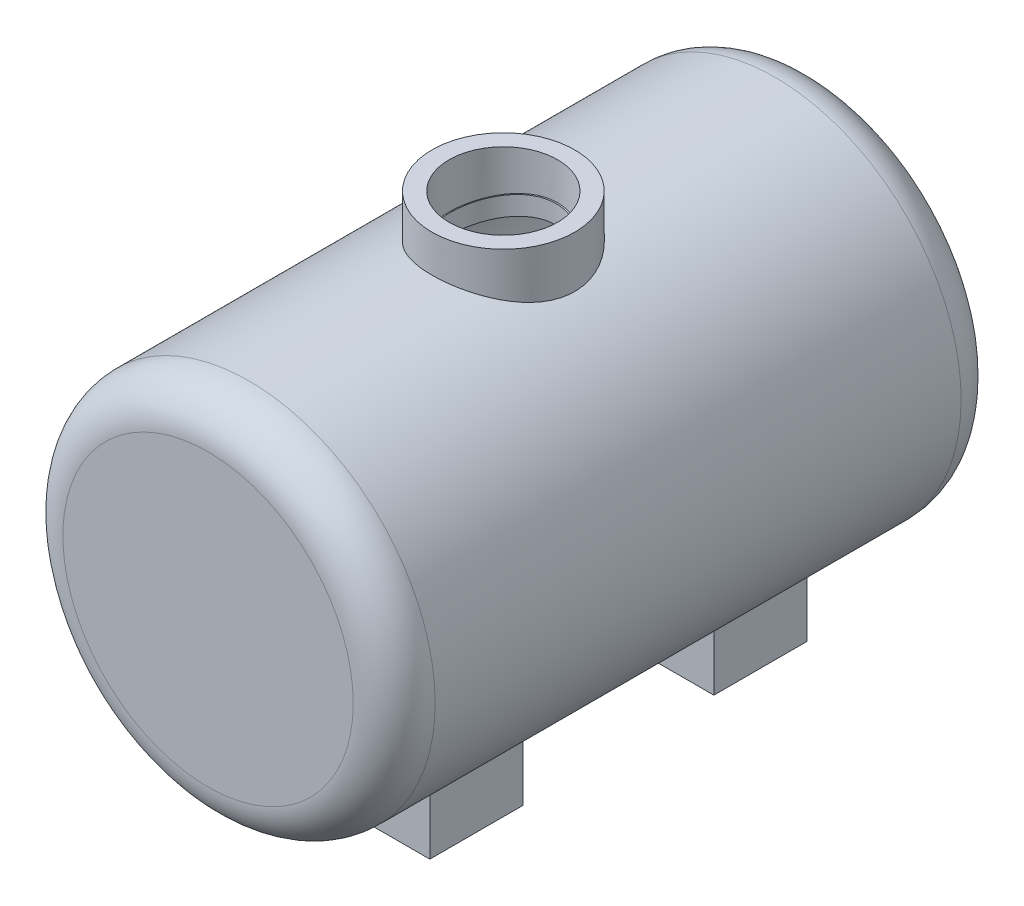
ISO-10303-21;
HEADER;
FILE_DESCRIPTION(('STEP AP214'),'2;1');
FILE_NAME('part.step','',(''),(''),'','','');
FILE_SCHEMA(('AUTOMOTIVE_DESIGN { 1 0 10303 214 1 1 1 1 }'));
ENDSEC;
DATA;
#1=APPLICATION_CONTEXT('core data for automotive mechanical design processes');
#2=APPLICATION_PROTOCOL_DEFINITION('international standard','automotive_design',2000,#1);
#3=PRODUCT_CONTEXT('',#1,'mechanical');
#4=PRODUCT('Part','Part','',(#3));
#5=PRODUCT_RELATED_PRODUCT_CATEGORY('part','',(#4));
#6=PRODUCT_DEFINITION_FORMATION('','',#4);
#7=PRODUCT_DEFINITION_CONTEXT('part definition',#1,'design');
#8=PRODUCT_DEFINITION('design','',#6,#7);
#9=PRODUCT_DEFINITION_SHAPE('','',#8);
#10=(LENGTH_UNIT() NAMED_UNIT(*) SI_UNIT(.MILLI.,.METRE.));
#11=(NAMED_UNIT(*) PLANE_ANGLE_UNIT() SI_UNIT($,.RADIAN.));
#12=(NAMED_UNIT(*) SI_UNIT($,.STERADIAN.) SOLID_ANGLE_UNIT());
#13=UNCERTAINTY_MEASURE_WITH_UNIT(LENGTH_MEASURE(1.E-05),#10,'distance_accuracy_value','');
#14=(GEOMETRIC_REPRESENTATION_CONTEXT(3) GLOBAL_UNCERTAINTY_ASSIGNED_CONTEXT((#13)) GLOBAL_UNIT_ASSIGNED_CONTEXT((#10,
#11,#12)) REPRESENTATION_CONTEXT('',''));
#15=CARTESIAN_POINT('',(0.,0.,0.));
#16=DIRECTION('',(0.,0.,1.));
#17=DIRECTION('',(1.,0.,0.));
#18=AXIS2_PLACEMENT_3D('',#15,#16,#17);
#19=CARTESIAN_POINT('',(0.,0.,1633.));
#20=DIRECTION('',(0.,0.,-1.));
#21=DIRECTION('',(-1.,0.,0.));
#22=AXIS2_PLACEMENT_3D('',#19,#20,#21);
#23=CYLINDRICAL_SURFACE('',#22,500.);
#24=DIRECTION('',(0.,0.,-1.));
#25=VECTOR('',#24,1.);
#26=CARTESIAN_POINT('',(285.691522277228,-410.34175280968,1633.));
#27=LINE('',#26,#25);
#28=CARTESIAN_POINT('',(285.691522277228,-410.34175280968,1323.));
#29=VERTEX_POINT('',#28);
#30=CARTESIAN_POINT('',(285.691522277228,-410.34175280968,1073.));
#31=VERTEX_POINT('',#30);
#32=EDGE_CURVE('E126',#29,#31,#27,.T.);
#33=ORIENTED_EDGE('',*,*,#32,.T.);
#34=CARTESIAN_POINT('',(0.,0.,1073.));
#35=DIRECTION('',(0.,0.,1.));
#36=DIRECTION('',(1.,0.,0.));
#37=AXIS2_PLACEMENT_3D('',#34,#35,#36);
#38=CIRCLE('',#37,500.);
#39=CARTESIAN_POINT('',(-361.875928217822,-345.030161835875,1073.));
#40=VERTEX_POINT('',#39);
#41=EDGE_CURVE('E146',#31,#40,#38,.F.);
#42=ORIENTED_EDGE('',*,*,#41,.T.);
#43=DIRECTION('',(0.,0.,-1.));
#44=VECTOR('',#43,1.);
#45=CARTESIAN_POINT('',(-361.875928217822,-345.030161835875,1633.));
#46=LINE('',#45,#44);
#47=CARTESIAN_POINT('',(-361.875928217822,-345.030161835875,1323.));
#48=VERTEX_POINT('',#47);
#49=EDGE_CURVE('E144',#40,#48,#46,.F.);
#50=ORIENTED_EDGE('',*,*,#49,.T.);
#51=CARTESIAN_POINT('',(0.,0.,1323.));
#52=DIRECTION('',(0.,0.,-1.));
#53=DIRECTION('',(-1.,0.,0.));
#54=AXIS2_PLACEMENT_3D('',#51,#52,#53);
#55=CIRCLE('',#54,500.);
#56=EDGE_CURVE('E141',#48,#29,#55,.F.);
#57=ORIENTED_EDGE('',*,*,#56,.T.);
#58=EDGE_LOOP('',(#33,#42,#50,#57));
#59=FACE_BOUND('',#58,.T.);
#60=CARTESIAN_POINT('',(0.,500.,1031.43041882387));
#61=CARTESIAN_POINT('',(2.59084852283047,500.000001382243,1031.43042068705));
#62=CARTESIAN_POINT('',(5.18164665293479,499.979851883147,1031.37788021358));
#63=CARTESIAN_POINT('',(10.3583138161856,499.899395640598,1031.16786289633));
#64=CARTESIAN_POINT('',(12.9441829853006,499.839090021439,1031.01038899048));
#65=CARTESIAN_POINT('',(18.1059396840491,499.678738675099,1030.59093409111));
#66=CARTESIAN_POINT('',(20.6818281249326,499.578696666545,1030.32896287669));
#67=CARTESIAN_POINT('',(25.8191130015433,499.339549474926,1029.70118430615));
#68=CARTESIAN_POINT('',(28.3805093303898,499.200444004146,1029.33537618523));
#69=CARTESIAN_POINT('',(33.4835935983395,498.88413796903,1028.50093204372));
#70=CARTESIAN_POINT('',(36.0252853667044,498.70694500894,1028.03231654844));
#71=CARTESIAN_POINT('',(41.0849140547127,498.315631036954,1026.99337512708));
#72=CARTESIAN_POINT('',(43.6028510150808,498.101510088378,1026.42304937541));
#73=CARTESIAN_POINT('',(48.6106243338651,497.637750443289,1025.18204496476));
#74=CARTESIAN_POINT('',(51.1004599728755,497.388110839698,1024.51136374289));
#75=CARTESIAN_POINT('',(56.0477162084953,496.854952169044,1023.07122565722));
#76=CARTESIAN_POINT('',(58.5051367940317,496.571433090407,1022.30176875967));
#77=CARTESIAN_POINT('',(63.3784832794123,495.972965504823,1020.66749428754));
#78=CARTESIAN_POINT('',(65.794483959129,495.658082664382,1019.80287557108));
#79=CARTESIAN_POINT('',(70.5862791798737,494.998410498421,1017.97886673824));
#80=CARTESIAN_POINT('',(72.9620737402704,494.653621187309,1017.01947666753));
#81=CARTESIAN_POINT('',(77.6696344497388,493.936328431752,1015.00797625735));
#82=CARTESIAN_POINT('',(80.0014032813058,493.563826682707,1013.95587158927));
#83=CARTESIAN_POINT('',(84.6177786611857,492.7933727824,1011.76087900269));
#84=CARTESIAN_POINT('',(86.9023808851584,492.395418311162,1010.61798280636));
#85=CARTESIAN_POINT('',(91.4211637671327,491.576488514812,1008.24351100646));
#86=CARTESIAN_POINT('',(93.6553382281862,491.155510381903,1007.01192458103));
#87=CARTESIAN_POINT('',(98.0700197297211,490.293106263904,1004.46231164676));
#88=CARTESIAN_POINT('',(100.250522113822,489.851678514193,1003.14427767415));
#89=CARTESIAN_POINT('',(104.554621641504,488.951086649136,1000.42416506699));
#90=CARTESIAN_POINT('',(106.678220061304,488.49192293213,999.022088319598));
#91=CARTESIAN_POINT('',(110.86573310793,487.55860262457,996.136155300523));
#92=CARTESIAN_POINT('',(112.929647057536,487.084445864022,994.652298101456));
#93=CARTESIAN_POINT('',(117.075850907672,486.104887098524,991.544579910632));
#94=CARTESIAN_POINT('',(119.155611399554,485.598992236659,989.917498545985));
#95=CARTESIAN_POINT('',(123.244737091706,484.577317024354,986.58007743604));
#96=CARTESIAN_POINT('',(125.254101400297,484.061536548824,984.869736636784));
#97=CARTESIAN_POINT('',(129.199546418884,483.023434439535,981.368515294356));
#98=CARTESIAN_POINT('',(131.13562887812,482.501112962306,979.577636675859));
#99=CARTESIAN_POINT('',(134.931973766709,481.453258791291,975.917851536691));
#100=CARTESIAN_POINT('',(136.792230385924,480.927725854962,974.048939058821));
#101=CARTESIAN_POINT('',(140.434596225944,479.876773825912,970.235425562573));
#102=CARTESIAN_POINT('',(142.216684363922,479.351354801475,968.290804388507));
#103=CARTESIAN_POINT('',(145.699574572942,478.304234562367,964.329118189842));
#104=CARTESIAN_POINT('',(147.400376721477,477.782533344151,962.312053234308));
#105=CARTESIAN_POINT('',(150.71824048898,476.746298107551,958.208177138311));
#106=CARTESIAN_POINT('',(152.335296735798,476.231764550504,956.121361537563));
#107=CARTESIAN_POINT('',(155.482886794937,475.213434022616,951.881200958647));
#108=CARTESIAN_POINT('',(157.013427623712,474.709636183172,949.727861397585));
#109=CARTESIAN_POINT('',(160.045657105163,473.696152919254,945.269231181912));
#110=CARTESIAN_POINT('',(161.543684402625,473.187051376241,942.961315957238));
#111=CARTESIAN_POINT('',(164.440599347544,472.188136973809,938.280322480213));
#112=CARTESIAN_POINT('',(165.83949630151,471.698322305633,935.907250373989));
#113=CARTESIAN_POINT('',(168.535746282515,470.741700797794,931.09910160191));
#114=CARTESIAN_POINT('',(169.833084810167,470.274897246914,928.664016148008));
#115=CARTESIAN_POINT('',(172.323150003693,469.368179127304,923.736355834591));
#116=CARTESIAN_POINT('',(173.515887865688,468.928261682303,921.243787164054));
#117=CARTESIAN_POINT('',(175.793958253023,468.079012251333,916.205735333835));
#118=CARTESIAN_POINT('',(176.879319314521,467.669672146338,913.660266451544));
#119=CARTESIAN_POINT('',(178.940446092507,466.884924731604,908.520171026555));
#120=CARTESIAN_POINT('',(179.91621151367,466.509517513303,905.925544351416));
#121=CARTESIAN_POINT('',(181.755667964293,465.795932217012,900.691946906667));
#122=CARTESIAN_POINT('',(182.619364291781,465.457752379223,898.052978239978));
#123=CARTESIAN_POINT('',(184.232458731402,464.82163573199,892.735552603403));
#124=CARTESIAN_POINT('',(184.981858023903,464.523698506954,890.057096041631));
#125=CARTESIAN_POINT('',(186.334938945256,463.982541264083,884.780407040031));
#126=CARTESIAN_POINT('',(186.943456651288,463.737535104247,882.183597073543));
#127=CARTESIAN_POINT('',(188.05219132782,463.289036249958,876.96340842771));
#128=CARTESIAN_POINT('',(188.552409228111,463.085543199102,874.340029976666));
#129=CARTESIAN_POINT('',(189.443166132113,462.721858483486,869.071774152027));
#130=CARTESIAN_POINT('',(189.833706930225,462.561666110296,866.426897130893));
#131=CARTESIAN_POINT('',(190.504015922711,462.286005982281,861.12081270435));
#132=CARTESIAN_POINT('',(190.7837839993,462.170538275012,858.459605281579));
#133=CARTESIAN_POINT('',(191.231652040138,461.98540453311,853.127223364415));
#134=CARTESIAN_POINT('',(191.399793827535,461.91572134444,850.456052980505));
#135=CARTESIAN_POINT('',(191.624082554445,461.822721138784,845.108197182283));
#136=CARTESIAN_POINT('',(191.680229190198,461.799404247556,842.431511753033));
#137=CARTESIAN_POINT('',(191.680360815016,461.799349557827,837.078238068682));
#138=CARTESIAN_POINT('',(191.624349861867,461.822610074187,834.401649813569));
#139=CARTESIAN_POINT('',(191.400339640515,461.915495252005,829.053994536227));
#140=CARTESIAN_POINT('',(191.232341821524,461.985119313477,826.382927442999));
#141=CARTESIAN_POINT('',(190.798983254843,462.164255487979,821.22002895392));
#142=CARTESIAN_POINT('',(190.54043670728,462.270972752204,818.727525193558));
#143=CARTESIAN_POINT('',(189.926147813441,462.523695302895,813.756553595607));
#144=CARTESIAN_POINT('',(189.570406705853,462.669700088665,811.278085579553));
#145=CARTESIAN_POINT('',(188.76263303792,462.999847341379,806.339586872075));
#146=CARTESIAN_POINT('',(188.310605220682,463.183987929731,803.879555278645));
#147=CARTESIAN_POINT('',(187.311340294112,463.588990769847,798.981954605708));
#148=CARTESIAN_POINT('',(186.764102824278,463.809853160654,796.544385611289));
#149=CARTESIAN_POINT('',(185.575640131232,464.286648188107,791.695476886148));
#150=CARTESIAN_POINT('',(184.934405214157,464.542584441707,789.284139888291));
#151=CARTESIAN_POINT('',(183.559436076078,465.087604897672,784.491791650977));
#152=CARTESIAN_POINT('',(182.825701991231,465.376689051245,782.110780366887));
#153=CARTESIAN_POINT('',(181.267332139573,465.98589474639,777.382781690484));
#154=CARTESIAN_POINT('',(180.442698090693,466.306015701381,775.035793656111));
#155=CARTESIAN_POINT('',(178.704137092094,466.97505170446,770.379060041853));
#156=CARTESIAN_POINT('',(177.790201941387,467.323969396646,768.06931790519));
#157=CARTESIAN_POINT('',(175.856407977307,468.055138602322,763.446404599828));
#158=CARTESIAN_POINT('',(174.834845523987,468.437903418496,761.134027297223));
#159=CARTESIAN_POINT('',(172.702750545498,469.228145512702,756.554720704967));
#160=CARTESIAN_POINT('',(171.592209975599,469.635625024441,754.287795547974));
#161=CARTESIAN_POINT('',(169.284371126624,470.472430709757,749.802935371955));
#162=CARTESIAN_POINT('',(168.087080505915,470.901754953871,747.584996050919));
#163=CARTESIAN_POINT('',(165.607628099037,471.779443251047,743.200695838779));
#164=CARTESIAN_POINT('',(164.325459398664,472.227808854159,741.034339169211));
#165=CARTESIAN_POINT('',(161.678123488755,473.140724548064,736.755705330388));
#166=CARTESIAN_POINT('',(160.312936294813,473.605278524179,734.643441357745));
#167=CARTESIAN_POINT('',(157.501969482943,474.54749696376,730.476238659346));
#168=CARTESIAN_POINT('',(156.056189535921,475.025161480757,728.421300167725));
#169=CARTESIAN_POINT('',(153.086090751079,475.990637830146,724.371222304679));
#170=CARTESIAN_POINT('',(151.561766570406,476.47845035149,722.376087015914));
#171=CARTESIAN_POINT('',(148.436947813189,477.461155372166,718.448410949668));
#172=CARTESIAN_POINT('',(146.836457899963,477.956047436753,716.515866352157));
#173=CARTESIAN_POINT('',(143.445772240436,478.985038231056,712.581505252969));
#174=CARTESIAN_POINT('',(141.650160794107,479.51943813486,710.584431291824));
#175=CARTESIAN_POINT('',(137.976778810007,480.58929250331,706.667619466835));
#176=CARTESIAN_POINT('',(136.099007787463,481.124746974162,704.747882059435));
#177=CARTESIAN_POINT('',(132.264014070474,482.193107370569,700.988542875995));
#178=CARTESIAN_POINT('',(130.306787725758,482.726013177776,699.148944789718));
#179=CARTESIAN_POINT('',(126.315846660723,483.785664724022,695.552837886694));
#180=CARTESIAN_POINT('',(124.282132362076,484.312410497,693.796328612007));
#181=CARTESIAN_POINT('',(120.14069209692,485.356338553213,690.368812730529));
#182=CARTESIAN_POINT('',(118.032949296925,485.873518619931,688.69782578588));
#183=CARTESIAN_POINT('',(113.747170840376,486.894683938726,685.444733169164));
#184=CARTESIAN_POINT('',(111.569141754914,487.398670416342,683.862619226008));
#185=CARTESIAN_POINT('',(107.145608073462,488.390168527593,680.789728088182));
#186=CARTESIAN_POINT('',(104.900097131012,488.877678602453,679.29895952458));
#187=CARTESIAN_POINT('',(100.345391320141,489.832845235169,676.411801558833));
#188=CARTESIAN_POINT('',(98.0362025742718,490.300503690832,675.015403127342));
#189=CARTESIAN_POINT('',(93.3178015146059,491.220584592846,672.296660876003));
#190=CARTESIAN_POINT('',(90.9075570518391,491.672614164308,670.97597450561));
#191=CARTESIAN_POINT('',(86.0286045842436,492.549715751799,668.43761235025));
#192=CARTESIAN_POINT('',(83.5598963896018,492.97478768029,667.219936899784));
#193=CARTESIAN_POINT('',(78.5681284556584,493.794944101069,664.890262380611));
#194=CARTESIAN_POINT('',(76.0450672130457,494.190027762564,663.778266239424));
#195=CARTESIAN_POINT('',(70.9490851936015,494.947333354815,661.66257776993));
#196=CARTESIAN_POINT('',(68.376164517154,495.309555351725,660.658885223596));
#197=CARTESIAN_POINT('',(63.1860862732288,495.998355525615,658.762598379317));
#198=CARTESIAN_POINT('',(60.568945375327,496.324946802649,657.869963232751));
#199=CARTESIAN_POINT('',(55.294406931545,496.940215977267,656.197628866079));
#200=CARTESIAN_POINT('',(52.6370092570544,497.228893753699,655.417930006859));
#201=CARTESIAN_POINT('',(47.2872619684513,497.766151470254,653.973573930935));
#202=CARTESIAN_POINT('',(44.5949141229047,498.014733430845,653.308910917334));
#203=CARTESIAN_POINT('',(39.1805385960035,498.469924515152,652.096408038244));
#204=CARTESIAN_POINT('',(36.4585112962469,498.67653417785,651.548566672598));
#205=CARTESIAN_POINT('',(31.1413271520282,499.035991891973,650.598229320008));
#206=CARTESIAN_POINT('',(28.5474620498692,499.191178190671,650.189379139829));
#207=CARTESIAN_POINT('',(23.3430895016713,499.461599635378,649.478388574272));
#208=CARTESIAN_POINT('',(20.7325822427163,499.576835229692,649.176246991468));
#209=CARTESIAN_POINT('',(15.499959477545,499.766550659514,648.679473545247));
#210=CARTESIAN_POINT('',(12.8778443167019,499.841031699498,648.484838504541));
#211=CARTESIAN_POINT('',(7.62697207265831,499.948722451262,648.203582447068));
#212=CARTESIAN_POINT('',(4.99821497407,499.981932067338,648.116961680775));
#213=CARTESIAN_POINT('',(-0.260291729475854,500.006843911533,648.051974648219));
#214=CARTESIAN_POINT('',(-2.89004101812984,499.998554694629,648.073586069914));
#215=CARTESIAN_POINT('',(-8.1459703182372,499.940546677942,648.224954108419));
#216=CARTESIAN_POINT('',(-10.7721503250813,499.890827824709,648.354710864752));
#217=CARTESIAN_POINT('',(-16.0158122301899,499.750310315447,648.722018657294));
#218=CARTESIAN_POINT('',(-18.6332942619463,499.65951229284,648.95956803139));
#219=CARTESIAN_POINT('',(-23.8545697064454,499.437470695,649.541829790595));
#220=CARTESIAN_POINT('',(-26.4583632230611,499.306227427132,649.886541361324));
#221=CARTESIAN_POINT('',(-31.5419239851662,499.010344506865,650.666057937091));
#222=CARTESIAN_POINT('',(-34.0224327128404,498.847278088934,651.09663424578));
#223=CARTESIAN_POINT('',(-38.9620737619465,498.485796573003,652.054568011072));
#224=CARTESIAN_POINT('',(-41.4212062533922,498.287381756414,652.581924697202));
#225=CARTESIAN_POINT('',(-46.3138989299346,497.856458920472,653.732185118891));
#226=CARTESIAN_POINT('',(-48.7474600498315,497.62395215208,654.355085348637));
#227=CARTESIAN_POINT('',(-53.5851368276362,497.126287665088,655.695055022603));
#228=CARTESIAN_POINT('',(-55.9892524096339,496.861129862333,656.412124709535));
#229=CARTESIAN_POINT('',(-60.7643917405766,496.299776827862,657.938935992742));
#230=CARTESIAN_POINT('',(-63.135413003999,496.003579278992,658.748684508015));
#231=CARTESIAN_POINT('',(-67.8405217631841,495.381968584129,660.459117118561));
#232=CARTESIAN_POINT('',(-70.1746093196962,495.056555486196,661.359801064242));
#233=CARTESIAN_POINT('',(-74.8023278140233,494.378479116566,663.250280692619));
#234=CARTESIAN_POINT('',(-77.0959594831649,494.025816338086,664.240074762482));
#235=CARTESIAN_POINT('',(-81.6396954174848,493.295302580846,666.306975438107));
#236=CARTESIAN_POINT('',(-83.8897956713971,492.917449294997,667.384090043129));
#237=CARTESIAN_POINT('',(-88.409313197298,492.127230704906,669.656868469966));
#238=CARTESIAN_POINT('',(-90.6773160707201,491.714173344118,670.855104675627));
#239=CARTESIAN_POINT('',(-95.1605297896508,490.866253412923,673.339853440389));
#240=CARTESIAN_POINT('',(-97.3757357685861,490.431388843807,674.626374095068));
#241=CARTESIAN_POINT('',(-101.749869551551,489.542586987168,677.285205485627));
#242=CARTESIAN_POINT('',(-103.908801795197,489.088651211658,678.657509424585));
#243=CARTESIAN_POINT('',(-108.167794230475,488.164395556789,681.485791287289));
#244=CARTESIAN_POINT('',(-110.267849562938,487.694074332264,682.941776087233));
#245=CARTESIAN_POINT('',(-114.406657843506,486.739795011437,685.935375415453));
#246=CARTESIAN_POINT('',(-116.445393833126,486.255833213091,687.473012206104));
#247=CARTESIAN_POINT('',(-120.458273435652,485.277312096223,690.627178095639));
#248=CARTESIAN_POINT('',(-122.432416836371,484.782752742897,692.243707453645));
#249=CARTESIAN_POINT('',(-126.313640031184,483.785984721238,695.55336687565));
#250=CARTESIAN_POINT('',(-128.220715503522,483.28377556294,697.246501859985));
#251=CARTESIAN_POINT('',(-131.965036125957,482.274806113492,700.70673945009));
#252=CARTESIAN_POINT('',(-133.802285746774,481.768046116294,702.473837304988));
#253=CARTESIAN_POINT('',(-137.514153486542,480.72216304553,706.189271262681));
#254=CARTESIAN_POINT('',(-139.384255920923,480.182944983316,708.142095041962));
#255=CARTESIAN_POINT('',(-143.040458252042,479.106521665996,712.125394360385));
#256=CARTESIAN_POINT('',(-144.826557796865,478.569316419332,714.155870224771));
#257=CARTESIAN_POINT('',(-148.312052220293,477.500636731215,718.291554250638));
#258=CARTESIAN_POINT('',(-150.011443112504,476.96916255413,720.39676584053));
#259=CARTESIAN_POINT('',(-153.320675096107,475.915733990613,724.678721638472));
#260=CARTESIAN_POINT('',(-154.930516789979,475.393779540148,726.8554653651));
#261=CARTESIAN_POINT('',(-158.058256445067,474.3630460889,731.277734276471));
#262=CARTESIAN_POINT('',(-159.576136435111,473.854269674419,733.523272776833));
#263=CARTESIAN_POINT('',(-162.516784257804,472.853790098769,738.079181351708));
#264=CARTESIAN_POINT('',(-163.939561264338,472.362085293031,740.389545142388));
#265=CARTESIAN_POINT('',(-166.687635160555,471.399355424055,745.07204890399));
#266=CARTESIAN_POINT('',(-168.012923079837,470.928332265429,747.444194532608));
#267=CARTESIAN_POINT('',(-170.563127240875,470.010697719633,752.246152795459));
#268=CARTESIAN_POINT('',(-171.788053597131,469.564083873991,754.675959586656));
#269=CARTESIAN_POINT('',(-174.142144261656,468.696166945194,759.604311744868));
#270=CARTESIAN_POINT('',(-175.270691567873,468.275031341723,762.103181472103));
#271=CARTESIAN_POINT('',(-177.421228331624,467.46446747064,767.151428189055));
#272=CARTESIAN_POINT('',(-178.443217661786,467.075039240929,769.700805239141));
#273=CARTESIAN_POINT('',(-180.378223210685,466.331181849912,774.845688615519));
#274=CARTESIAN_POINT('',(-181.291237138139,465.976753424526,777.441195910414));
#275=CARTESIAN_POINT('',(-183.005965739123,465.305989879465,782.673583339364));
#276=CARTESIAN_POINT('',(-183.807680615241,464.989654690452,785.310463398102));
#277=CARTESIAN_POINT('',(-185.297282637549,464.398061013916,790.61918905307));
#278=CARTESIAN_POINT('',(-185.985231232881,464.122780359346,793.291014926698));
#279=CARTESIAN_POINT('',(-187.245919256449,463.615603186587,798.665812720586));
#280=CARTESIAN_POINT('',(-187.818658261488,463.383706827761,801.368784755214));
#281=CARTESIAN_POINT('',(-188.84723509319,462.965473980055,806.800215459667));
#282=CARTESIAN_POINT('',(-189.303079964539,462.779134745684,809.528672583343));
#283=CARTESIAN_POINT('',(-190.096542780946,462.453769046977,815.005509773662));
#284=CARTESIAN_POINT('',(-190.434162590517,462.31474183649,817.753889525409));
#285=CARTESIAN_POINT('',(-190.971550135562,462.093005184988,823.080370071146));
#286=CARTESIAN_POINT('',(-191.179027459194,462.007150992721,825.657565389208));
#287=CARTESIAN_POINT('',(-191.489583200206,461.878520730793,830.8192923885));
#288=CARTESIAN_POINT('',(-191.592663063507,461.835744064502,833.403823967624));
#289=CARTESIAN_POINT('',(-191.694139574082,461.793633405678,838.575188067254));
#290=CARTESIAN_POINT('',(-191.69254045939,461.794297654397,841.162020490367));
#291=CARTESIAN_POINT('',(-191.584674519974,461.839058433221,846.333133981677));
#292=CARTESIAN_POINT('',(-191.478407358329,461.883155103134,848.917415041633));
#293=CARTESIAN_POINT('',(-191.161514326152,462.014398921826,854.078202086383));
#294=CARTESIAN_POINT('',(-190.950899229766,462.101541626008,856.654708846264));
#295=CARTESIAN_POINT('',(-190.425889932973,462.318138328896,861.795336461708));
#296=CARTESIAN_POINT('',(-190.111495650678,462.447592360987,864.359457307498));
#297=CARTESIAN_POINT('',(-189.379772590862,462.74772611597,869.470518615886));
#298=CARTESIAN_POINT('',(-188.962444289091,462.918405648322,872.017459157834));
#299=CARTESIAN_POINT('',(-188.025943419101,463.299579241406,877.089523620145));
#300=CARTESIAN_POINT('',(-187.506771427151,463.510073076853,879.614647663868));
#301=CARTESIAN_POINT('',(-186.38695496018,463.961480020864,884.554548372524));
#302=CARTESIAN_POINT('',(-185.789617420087,464.201139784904,886.970190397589));
#303=CARTESIAN_POINT('',(-184.502393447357,464.714263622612,891.773035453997));
#304=CARTESIAN_POINT('',(-183.812507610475,464.987727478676,894.1602386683));
#305=CARTESIAN_POINT('',(-182.341720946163,465.566451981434,898.902427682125));
#306=CARTESIAN_POINT('',(-181.560823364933,465.871711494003,901.257414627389));
#307=CARTESIAN_POINT('',(-179.909623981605,466.511855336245,905.93174296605));
#308=CARTESIAN_POINT('',(-179.039321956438,466.846739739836,908.251084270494));
#309=CARTESIAN_POINT('',(-177.210919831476,467.543845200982,912.8510957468));
#310=CARTESIAN_POINT('',(-176.252807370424,467.906070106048,915.131760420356));
#311=CARTESIAN_POINT('',(-174.25061858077,468.655379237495,919.651101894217));
#312=CARTESIAN_POINT('',(-173.206535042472,469.042465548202,921.889775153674));
#313=CARTESIAN_POINT('',(-171.034357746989,469.83889422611,926.321911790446));
#314=CARTESIAN_POINT('',(-169.906264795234,470.248236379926,928.515375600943));
#315=CARTESIAN_POINT('',(-167.567970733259,471.086528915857,932.854282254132));
#316=CARTESIAN_POINT('',(-166.357768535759,471.515479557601,934.999724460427));
#317=CARTESIAN_POINT('',(-163.789580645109,472.413931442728,939.354539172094));
#318=CARTESIAN_POINT('',(-162.427142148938,472.884371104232,941.561093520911));
#319=CARTESIAN_POINT('',(-159.615523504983,473.840785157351,945.914786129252));
#320=CARTESIAN_POINT('',(-158.166342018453,474.326759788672,948.061923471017));
#321=CARTESIAN_POINT('',(-155.18360020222,475.310967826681,952.293832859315));
#322=CARTESIAN_POINT('',(-153.65004202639,475.80920092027,954.378606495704));
#323=CARTESIAN_POINT('',(-150.500874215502,476.814659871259,958.483082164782));
#324=CARTESIAN_POINT('',(-148.885257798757,477.321886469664,960.502778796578));
#325=CARTESIAN_POINT('',(-143.918279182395,478.852306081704,966.460821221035));
#326=CARTESIAN_POINT('',(-140.446903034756,479.884200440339,970.297955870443));
#327=CARTESIAN_POINT('',(-133.204783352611,481.944658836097,977.67965866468));
#328=CARTESIAN_POINT('',(-129.434029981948,482.97322276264,981.224217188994));
#329=CARTESIAN_POINT('',(-123.456802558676,484.523463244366,986.403605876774));
#330=CARTESIAN_POINT('',(-121.350110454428,485.055694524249,988.15155387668));
#331=CARTESIAN_POINT('',(-117.062054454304,486.108369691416,991.556924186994));
#332=CARTESIAN_POINT('',(-114.880697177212,486.628814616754,993.214354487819));
#333=CARTESIAN_POINT('',(-110.446305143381,487.654379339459,996.435992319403));
#334=CARTESIAN_POINT('',(-108.19326135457,488.159497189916,998.000188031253));
#335=CARTESIAN_POINT('',(-103.619432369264,489.150782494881,1001.03209988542));
#336=CARTESIAN_POINT('',(-101.298654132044,489.636951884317,1002.49982588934));
#337=CARTESIAN_POINT('',(-96.5922238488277,490.587104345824,1005.33644230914));
#338=CARTESIAN_POINT('',(-94.2065559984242,491.051081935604,1006.70530834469));
#339=CARTESIAN_POINT('',(-89.3747636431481,491.953444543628,1009.340985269));
#340=CARTESIAN_POINT('',(-86.9286393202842,492.391829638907,1010.60779646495));
#341=CARTESIAN_POINT('',(-81.9799253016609,493.239895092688,1013.03666335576));
#342=CARTESIAN_POINT('',(-79.477333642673,493.649574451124,1014.19871540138));
#343=CARTESIAN_POINT('',(-74.4200779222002,494.437257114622,1016.41537231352));
#344=CARTESIAN_POINT('',(-71.8654131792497,494.815260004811,1017.46997577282));
#345=CARTESIAN_POINT('',(-66.5472260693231,495.559400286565,1019.53175881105));
#346=CARTESIAN_POINT('',(-63.7806369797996,495.923315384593,1020.53184234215));
#347=CARTESIAN_POINT('',(-58.1996274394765,496.609210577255,1022.40499821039));
#348=CARTESIAN_POINT('',(-55.3852063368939,496.931190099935,1023.27806881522));
#349=CARTESIAN_POINT('',(-49.7144585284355,497.530503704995,1024.89466548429));
#350=CARTESIAN_POINT('',(-46.8581286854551,497.807834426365,1025.63818179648));
#351=CARTESIAN_POINT('',(-41.1102134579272,498.315436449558,1026.99329310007));
#352=CARTESIAN_POINT('',(-38.2186282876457,498.545708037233,1027.60488889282));
#353=CARTESIAN_POINT('',(-32.4082374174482,498.957096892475,1028.69396253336));
#354=CARTESIAN_POINT('',(-29.4894450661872,499.138237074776,1029.17150290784));
#355=CARTESIAN_POINT('',(-23.6301979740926,499.449918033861,1029.99128633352));
#356=CARTESIAN_POINT('',(-20.6897430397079,499.580458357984,1030.33352817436));
#357=CARTESIAN_POINT('',(-14.7946784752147,499.789771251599,1030.8815315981));
#358=CARTESIAN_POINT('',(-11.8400706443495,499.868550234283,1031.08731008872));
#359=CARTESIAN_POINT('',(-5.92361976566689,499.973662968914,1031.36175041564));
#360=CARTESIAN_POINT('',(-2.96177695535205,499.999998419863,1031.43041669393));
#361=CARTESIAN_POINT('',(0.,500.,1031.43041882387));
#362=B_SPLINE_CURVE_WITH_KNOTS('',3,(#60,#61,#62,#63,#64,#65,#66,#67,#68,#69,#70,#71,#72,#73,
#74,#75,#76,#77,#78,#79,#80,#81,#82,#83,#84,#85,#86,#87,#88,#89,#90,#91,#92,#93,#94,#95,#96,#97,
#98,#99,#100,#101,#102,#103,#104,#105,#106,#107,#108,#109,#110,#111,#112,#113,#114,#115,#116,
#117,#118,#119,#120,#121,#122,#123,#124,#125,#126,#127,#128,#129,#130,#131,#132,#133,#134,#135,
#136,#137,#138,#139,#140,#141,#142,#143,#144,#145,#146,#147,#148,#149,#150,#151,#152,#153,#154,
#155,#156,#157,#158,#159,#160,#161,#162,#163,#164,#165,#166,#167,#168,#169,#170,#171,#172,#173,
#174,#175,#176,#177,#178,#179,#180,#181,#182,#183,#184,#185,#186,#187,#188,#189,#190,#191,#192,
#193,#194,#195,#196,#197,#198,#199,#200,#201,#202,#203,#204,#205,#206,#207,#208,#209,#210,#211,
#212,#213,#214,#215,#216,#217,#218,#219,#220,#221,#222,#223,#224,#225,#226,#227,#228,#229,#230,
#231,#232,#233,#234,#235,#236,#237,#238,#239,#240,#241,#242,#243,#244,#245,#246,#247,#248,#249,
#250,#251,#252,#253,#254,#255,#256,#257,#258,#259,#260,#261,#262,#263,#264,#265,#266,#267,#268,
#269,#270,#271,#272,#273,#274,#275,#276,#277,#278,#279,#280,#281,#282,#283,#284,#285,#286,#287,
#288,#289,#290,#291,#292,#293,#294,#295,#296,#297,#298,#299,#300,#301,#302,#303,#304,#305,#306,
#307,#308,#309,#310,#311,#312,#313,#314,#315,#316,#317,#318,#319,#320,#321,#322,#323,#324,#325,
#326,#327,#328,#329,#330,#331,#332,#333,#334,#335,#336,#337,#338,#339,#340,#341,#342,#343,#344,
#345,#346,#347,#348,#349,#350,#351,#352,#353,#354,#355,#356,#357,#358,#359,#360,#361),
.UNSPECIFIED.,.T.,.F.,(4,2,2,2,2,2,2,2,2,2,2,2,2,2,2,2,2,2,2,2,2,2,2,2,2,2,2,2,2,2,2,2,2,2,2,2,
2,2,2,2,2,2,2,2,2,2,2,2,2,2,2,2,2,2,2,2,2,2,2,2,2,2,2,2,2,2,2,2,2,2,2,2,2,2,2,2,2,2,2,2,2,2,2,2,
2,2,2,2,2,2,2,2,2,2,2,2,2,2,2,2,2,2,2,2,2,2,2,2,2,2,2,2,2,2,2,2,2,2,2,2,2,2,2,2,2,2,2,2,2,2,2,2,
2,2,2,2,2,2,2,2,2,2,2,2,2,2,2,2,2,2,4),(0.,7.77184809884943,15.5434786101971,23.3143820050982,
31.0853426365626,38.854753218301,46.624150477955,54.3937461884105,62.1633445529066,
69.9170045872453,77.6706608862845,85.4238432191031,93.1777332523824,100.932571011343,
108.688079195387,116.443413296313,124.198835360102,132.262468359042,140.326203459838,
148.389745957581,156.453905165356,164.520226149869,172.58653944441,180.653369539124,
188.719544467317,197.111468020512,205.502602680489,213.894933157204,222.286364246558,
230.675559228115,239.064776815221,247.453597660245,255.842331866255,263.874884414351,
271.907367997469,279.939720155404,287.972080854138,296.001430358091,304.03080163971,
312.059882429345,320.088859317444,327.611092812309,335.133230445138,342.654997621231,
350.176793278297,357.699365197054,365.22192604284,372.744344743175,380.267454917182,
387.935733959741,395.604707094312,403.273004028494,410.94192639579,418.612702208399,
426.283509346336,433.954838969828,441.625699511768,449.83814688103,458.050642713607,
466.263516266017,474.476344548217,482.69105260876,490.904994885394,499.119712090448,
507.333642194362,515.686868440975,524.040121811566,532.393606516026,540.747074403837,
549.097460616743,557.447873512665,565.797865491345,574.147750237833,582.036679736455,
589.925520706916,597.814128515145,605.702754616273,613.589754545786,621.476764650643,
629.363653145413,637.25048170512,644.81692509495,652.383308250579,659.949413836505,
667.515538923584,675.082229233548,682.64890709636,690.215448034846,697.782682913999,
705.574884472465,713.367801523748,721.160101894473,728.953043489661,736.74812084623,
744.543223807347,752.338828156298,760.133932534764,768.402813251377,776.671728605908,
784.941023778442,793.210263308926,801.481113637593,809.751164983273,818.021976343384,
826.291953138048,834.611424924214,842.930906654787,851.250563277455,859.570204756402,
867.885337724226,876.200501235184,884.515163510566,892.829694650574,900.588132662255,
908.346463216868,916.104479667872,923.86252109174,931.619761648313,939.377008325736,
947.134219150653,954.891386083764,962.389023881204,969.886613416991,977.383935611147,
984.881276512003,992.379674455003,999.8787018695,1007.37765739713,1014.87671224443,
1022.78135376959,1030.68611732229,1038.59067918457,1046.4958953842,1062.30693783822,
1078.11849998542,1086.48242018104,1094.84560085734,1103.20983944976,1111.57322167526,
1119.93865944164,1128.30407202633,1136.66977590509,1145.03558933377,1153.92484974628,
1162.81423138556,1171.70428187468,1180.59427836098,1189.48012142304,1198.36604397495,
1207.25086535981,1216.1353989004),.UNSPECIFIED.);
#363=CARTESIAN_POINT('',(0.,500.,1031.43041882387));
#364=VERTEX_POINT('',#363);
#365=EDGE_CURVE('E188',#364,#364,#362,.T.);
#366=ORIENTED_EDGE('',*,*,#365,.F.);
#367=EDGE_LOOP('',(#366));
#368=FACE_BOUND('',#367,.T.);
#369=CARTESIAN_POINT('',(0.,0.,110.));
#370=DIRECTION('',(0.,0.,1.));
#371=DIRECTION('',(1.,0.,0.));
#372=AXIS2_PLACEMENT_3D('',#369,#370,#371);
#373=CIRCLE('',#372,500.);
#374=CARTESIAN_POINT('',(500.,0.,110.));
#375=VERTEX_POINT('',#374);
#376=EDGE_CURVE('E233',#375,#375,#373,.T.);
#377=ORIENTED_EDGE('',*,*,#376,.T.);
#378=EDGE_LOOP('',(#377));
#379=FACE_BOUND('',#378,.T.);
#380=CARTESIAN_POINT('',(0.,0.,1523.));
#381=DIRECTION('',(0.,0.,1.));
#382=DIRECTION('',(1.,0.,0.));
#383=AXIS2_PLACEMENT_3D('',#380,#381,#382);
#384=CIRCLE('',#383,500.);
#385=CARTESIAN_POINT('',(500.,0.,1523.));
#386=VERTEX_POINT('',#385);
#387=EDGE_CURVE('E195',#386,#386,#384,.F.);
#388=ORIENTED_EDGE('',*,*,#387,.T.);
#389=EDGE_LOOP('',(#388));
#390=FACE_BOUND('',#389,.T.);
#391=DIRECTION('',(0.,0.,-1.));
#392=VECTOR('',#391,1.);
#393=CARTESIAN_POINT('',(285.691522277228,-410.34175280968,1633.));
#394=LINE('',#393,#392);
#395=CARTESIAN_POINT('',(285.691522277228,-410.34175280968,560.));
#396=VERTEX_POINT('',#395);
#397=CARTESIAN_POINT('',(285.691522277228,-410.34175280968,310.));
#398=VERTEX_POINT('',#397);
#399=EDGE_CURVE('E50',#396,#398,#394,.T.);
#400=ORIENTED_EDGE('',*,*,#399,.T.);
#401=CARTESIAN_POINT('',(0.,0.,310.));
#402=DIRECTION('',(0.,0.,1.));
#403=DIRECTION('',(1.,0.,0.));
#404=AXIS2_PLACEMENT_3D('',#401,#402,#403);
#405=CIRCLE('',#404,500.);
#406=CARTESIAN_POINT('',(-361.875928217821,-345.030161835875,310.));
#407=VERTEX_POINT('',#406);
#408=EDGE_CURVE('E54',#398,#407,#405,.F.);
#409=ORIENTED_EDGE('',*,*,#408,.T.);
#410=DIRECTION('',(0.,0.,-1.));
#411=VECTOR('',#410,1.);
#412=CARTESIAN_POINT('',(-361.875928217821,-345.030161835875,1633.));
#413=LINE('',#412,#411);
#414=CARTESIAN_POINT('',(-361.875928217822,-345.030161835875,560.));
#415=VERTEX_POINT('',#414);
#416=EDGE_CURVE('E95',#407,#415,#413,.F.);
#417=ORIENTED_EDGE('',*,*,#416,.T.);
#418=CARTESIAN_POINT('',(0.,0.,560.));
#419=DIRECTION('',(0.,0.,-1.));
#420=DIRECTION('',(-1.,0.,0.));
#421=AXIS2_PLACEMENT_3D('',#418,#419,#420);
#422=CIRCLE('',#421,500.);
#423=EDGE_CURVE('E98',#415,#396,#422,.F.);
#424=ORIENTED_EDGE('',*,*,#423,.T.);
#425=EDGE_LOOP('',(#400,#409,#417,#424));
#426=FACE_BOUND('',#425,.T.);
#427=ADVANCED_FACE('F31',(#59,#368,#379,#390,#426),#23,.T.);
#428=CARTESIAN_POINT('',(0.,0.,1633.));
#429=DIRECTION('',(0.,0.,1.));
#430=DIRECTION('',(1.,0.,0.));
#431=AXIS2_PLACEMENT_3D('',#428,#429,#430);
#432=PLANE('',#431);
#433=CARTESIAN_POINT('',(0.,0.,1633.));
#434=DIRECTION('',(0.,0.,1.));
#435=DIRECTION('',(1.,0.,0.));
#436=AXIS2_PLACEMENT_3D('',#433,#434,#435);
#437=CIRCLE('',#436,390.);
#438=CARTESIAN_POINT('',(390.,0.,1633.));
#439=VERTEX_POINT('',#438);
#440=EDGE_CURVE('E43',#439,#439,#437,.T.);
#441=ORIENTED_EDGE('',*,*,#440,.T.);
#442=EDGE_LOOP('',(#441));
#443=FACE_BOUND('',#442,.T.);
#444=ADVANCED_FACE('F209',(#443),#432,.T.);
#445=CARTESIAN_POINT('',(0.,0.,0.));
#446=DIRECTION('',(0.,0.,1.));
#447=DIRECTION('',(1.,0.,0.));
#448=AXIS2_PLACEMENT_3D('',#445,#446,#447);
#449=PLANE('',#448);
#450=CARTESIAN_POINT('',(0.,0.,0.));
#451=DIRECTION('',(0.,0.,1.));
#452=DIRECTION('',(1.,0.,0.));
#453=AXIS2_PLACEMENT_3D('',#450,#451,#452);
#454=CIRCLE('',#453,390.);
#455=CARTESIAN_POINT('',(390.,0.,0.));
#456=VERTEX_POINT('',#455);
#457=EDGE_CURVE('E230',#456,#456,#454,.F.);
#458=ORIENTED_EDGE('',*,*,#457,.T.);
#459=EDGE_LOOP('',(#458));
#460=FACE_BOUND('',#459,.T.);
#461=ADVANCED_FACE('F212',(#460),#449,.F.);
#462=CARTESIAN_POINT('',(0.,0.,110.));
#463=DIRECTION('',(0.,0.,1.));
#464=DIRECTION('',(1.,0.,0.));
#465=AXIS2_PLACEMENT_3D('',#462,#463,#464);
#466=TOROIDAL_SURFACE('',#465,390.,110.);
#467=ORIENTED_EDGE('',*,*,#457,.F.);
#468=EDGE_LOOP('',(#467));
#469=FACE_BOUND('',#468,.T.);
#470=ORIENTED_EDGE('',*,*,#376,.F.);
#471=EDGE_LOOP('',(#470));
#472=FACE_BOUND('',#471,.T.);
#473=ADVANCED_FACE('F215',(#469,#472),#466,.T.);
#474=CARTESIAN_POINT('',(0.,0.,1523.));
#475=DIRECTION('',(0.,0.,1.));
#476=DIRECTION('',(1.,0.,0.));
#477=AXIS2_PLACEMENT_3D('',#474,#475,#476);
#478=TOROIDAL_SURFACE('',#477,390.,110.);
#479=ORIENTED_EDGE('',*,*,#387,.F.);
#480=EDGE_LOOP('',(#479));
#481=FACE_BOUND('',#480,.T.);
#482=ORIENTED_EDGE('',*,*,#440,.F.);
#483=EDGE_LOOP('',(#482));
#484=FACE_BOUND('',#483,.T.);
#485=ADVANCED_FACE('F33',(#481,#484),#478,.T.);
#486=CARTESIAN_POINT('',(0.,-500.001,839.75012376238));
#487=DIRECTION('',(0.,1.,0.));
#488=DIRECTION('',(0.,0.,1.));
#489=AXIS2_PLACEMENT_3D('',#486,#487,#488);
#490=CYLINDRICAL_SURFACE('',#489,191.680295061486);
#491=CARTESIAN_POINT('',(0.,600.,839.75012376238));
#492=DIRECTION('',(0.,1.,0.));
#493=DIRECTION('',(0.,0.,1.));
#494=AXIS2_PLACEMENT_3D('',#491,#492,#493);
#495=CIRCLE('',#494,191.680295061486);
#496=CARTESIAN_POINT('',(0.,600.,1031.43041882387));
#497=VERTEX_POINT('',#496);
#498=EDGE_CURVE('E196',#497,#497,#495,.T.);
#499=ORIENTED_EDGE('',*,*,#498,.F.);
#500=EDGE_LOOP('',(#499));
#501=FACE_BOUND('',#500,.T.);
#502=ORIENTED_EDGE('',*,*,#365,.T.);
#503=EDGE_LOOP('',(#502));
#504=FACE_BOUND('',#503,.T.);
#505=ADVANCED_FACE('F203',(#501,#504),#490,.T.);
#506=CARTESIAN_POINT('',(0.,600.,839.75012376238));
#507=DIRECTION('',(0.,1.,0.));
#508=DIRECTION('',(0.,0.,1.));
#509=AXIS2_PLACEMENT_3D('',#506,#507,#508);
#510=PLANE('',#509);
#511=CARTESIAN_POINT('',(0.,600.,839.75012376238));
#512=DIRECTION('',(0.,1.,0.));
#513=DIRECTION('',(0.,0.,1.));
#514=AXIS2_PLACEMENT_3D('',#511,#512,#513);
#515=CIRCLE('',#514,145.688498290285);
#516=CARTESIAN_POINT('',(0.,600.,985.438622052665));
#517=VERTEX_POINT('',#516);
#518=EDGE_CURVE('E201',#517,#517,#515,.T.);
#519=ORIENTED_EDGE('',*,*,#518,.F.);
#520=EDGE_LOOP('',(#519));
#521=FACE_BOUND('',#520,.T.);
#522=ORIENTED_EDGE('',*,*,#498,.T.);
#523=EDGE_LOOP('',(#522));
#524=FACE_BOUND('',#523,.T.);
#525=ADVANCED_FACE('F207',(#521,#524),#510,.T.);
#526=CARTESIAN_POINT('',(0.,-500.001,839.75012376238));
#527=DIRECTION('',(0.,1.,0.));
#528=DIRECTION('',(0.,0.,1.));
#529=AXIS2_PLACEMENT_3D('',#526,#527,#528);
#530=CYLINDRICAL_SURFACE('',#529,145.688498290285);
#531=ORIENTED_EDGE('',*,*,#518,.T.);
#532=EDGE_LOOP('',(#531));
#533=FACE_BOUND('',#532,.T.);
#534=CARTESIAN_POINT('',(0.,500.,985.438622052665));
#535=CARTESIAN_POINT('',(-2.00082499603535,499.999999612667,985.438621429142));
#536=CARTESIAN_POINT('',(-4.00167210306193,499.987982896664,985.397395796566));
#537=CARTESIAN_POINT('',(-7.9997027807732,499.939998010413,985.232584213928));
#538=CARTESIAN_POINT('',(-9.99688629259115,499.904029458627,985.108996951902));
#539=CARTESIAN_POINT('',(-13.9840095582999,499.808387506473,984.779733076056));
#540=CARTESIAN_POINT('',(-15.9739489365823,499.748712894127,984.574052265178));
#541=CARTESIAN_POINT('',(-19.9428395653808,499.606071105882,984.081064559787));
#542=CARTESIAN_POINT('',(-21.9217908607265,499.523104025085,983.793757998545));
#543=CARTESIAN_POINT('',(-25.8657326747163,499.334419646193,983.138058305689));
#544=CARTESIAN_POINT('',(-27.8307188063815,499.228695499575,982.769640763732));
#545=CARTESIAN_POINT('',(-31.7426182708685,498.995236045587,981.95257584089));
#546=CARTESIAN_POINT('',(-33.6895315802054,498.867500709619,981.503928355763));
#547=CARTESIAN_POINT('',(-37.5617322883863,498.590898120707,980.527399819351));
#548=CARTESIAN_POINT('',(-39.4870210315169,498.442032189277,979.999523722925));
#549=CARTESIAN_POINT('',(-43.3129420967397,498.124155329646,978.865575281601));
#550=CARTESIAN_POINT('',(-45.2135720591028,497.955142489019,978.259495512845));
#551=CARTESIAN_POINT('',(-48.9839035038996,497.598389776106,976.971399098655));
#552=CARTESIAN_POINT('',(-50.8536473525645,497.410678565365,976.289498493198));
#553=CARTESIAN_POINT('',(-54.562039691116,497.017565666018,974.850376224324));
#554=CARTESIAN_POINT('',(-56.4006879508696,496.812163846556,974.093154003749));
#555=CARTESIAN_POINT('',(-60.0438513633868,496.385031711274,972.504872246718));
#556=CARTESIAN_POINT('',(-61.8483668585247,496.163301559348,971.673813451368));
#557=CARTESIAN_POINT('',(-65.4204025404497,495.704966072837,969.93941443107));
#558=CARTESIAN_POINT('',(-67.1879224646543,495.468360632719,969.036073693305));
#559=CARTESIAN_POINT('',(-70.683214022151,494.981814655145,967.158746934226));
#560=CARTESIAN_POINT('',(-72.4109846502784,494.731873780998,966.184759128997));
#561=CARTESIAN_POINT('',(-75.8241958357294,494.220264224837,964.167806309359));
#562=CARTESIAN_POINT('',(-77.509632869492,493.958594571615,963.124835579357));
#563=CARTESIAN_POINT('',(-80.8353335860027,493.425257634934,960.971866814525));
#564=CARTESIAN_POINT('',(-82.4756005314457,493.153591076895,959.861873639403));
#565=CARTESIAN_POINT('',(-85.708759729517,492.601967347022,957.576548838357));
#566=CARTESIAN_POINT('',(-87.3016475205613,492.32200939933,956.4012110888));
#567=CARTESIAN_POINT('',(-90.4758178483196,491.748706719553,953.957714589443));
#568=CARTESIAN_POINT('',(-92.0558661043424,491.455202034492,952.687989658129));
#569=CARTESIAN_POINT('',(-95.1612732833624,490.863352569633,950.084058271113));
#570=CARTESIAN_POINT('',(-96.6866259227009,490.565007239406,948.74984444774));
#571=CARTESIAN_POINT('',(-99.6800836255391,489.965520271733,946.019233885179));
#572=CARTESIAN_POINT('',(-101.148187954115,489.664378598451,944.622836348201));
#573=CARTESIAN_POINT('',(-104.024654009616,489.061377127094,941.770279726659));
#574=CARTESIAN_POINT('',(-105.433022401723,488.759517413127,940.314127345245));
#575=CARTESIAN_POINT('',(-108.188297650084,488.157025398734,937.343849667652));
#576=CARTESIAN_POINT('',(-109.535188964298,487.856393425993,935.829709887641));
#577=CARTESIAN_POINT('',(-112.164836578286,487.258522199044,932.746323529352));
#578=CARTESIAN_POINT('',(-113.4475987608,486.961282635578,931.177082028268));
#579=CARTESIAN_POINT('',(-115.947133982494,486.372193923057,927.985656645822));
#580=CARTESIAN_POINT('',(-117.163900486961,486.08034530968,926.363467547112));
#581=CARTESIAN_POINT('',(-119.529156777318,485.504132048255,923.068974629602));
#582=CARTESIAN_POINT('',(-120.677652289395,485.219766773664,921.396675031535));
#583=CARTESIAN_POINT('',(-122.928025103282,484.654593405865,917.968609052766));
#584=CARTESIAN_POINT('',(-124.028404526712,484.373987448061,916.21182565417));
#585=CARTESIAN_POINT('',(-126.15396533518,483.824743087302,912.651522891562));
#586=CARTESIAN_POINT('',(-127.179146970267,483.556104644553,910.848003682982));
#587=CARTESIAN_POINT('',(-129.152378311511,483.032819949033,907.197194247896));
#588=CARTESIAN_POINT('',(-130.100425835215,482.778174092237,905.349902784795));
#589=CARTESIAN_POINT('',(-131.917465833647,482.284841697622,901.614765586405));
#590=CARTESIAN_POINT('',(-132.786458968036,482.046155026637,899.726920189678));
#591=CARTESIAN_POINT('',(-134.443518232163,481.586627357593,895.914161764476));
#592=CARTESIAN_POINT('',(-135.231593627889,481.365784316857,893.989253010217));
#593=CARTESIAN_POINT('',(-136.725178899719,480.943684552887,890.105774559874));
#594=CARTESIAN_POINT('',(-137.430697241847,480.742425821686,888.147208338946));
#595=CARTESIAN_POINT('',(-138.757729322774,480.36108214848,884.199725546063));
#596=CARTESIAN_POINT('',(-139.379240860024,480.180997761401,882.210808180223));
#597=CARTESIAN_POINT('',(-140.536826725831,479.843478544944,878.206367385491));
#598=CARTESIAN_POINT('',(-141.072901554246,479.686043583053,876.190844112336));
#599=CARTESIAN_POINT('',(-142.045276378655,479.398987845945,872.190856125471));
#600=CARTESIAN_POINT('',(-142.483848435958,479.268739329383,870.206988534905));
#601=CARTESIAN_POINT('',(-143.27786015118,479.031968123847,866.221284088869));
#602=CARTESIAN_POINT('',(-143.633300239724,478.925445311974,864.219447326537));
#603=CARTESIAN_POINT('',(-144.260223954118,478.736978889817,860.201539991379));
#604=CARTESIAN_POINT('',(-144.531708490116,478.655035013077,858.1854695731));
#605=CARTESIAN_POINT('',(-144.990088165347,478.516386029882,854.142866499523));
#606=CARTESIAN_POINT('',(-145.176983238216,478.459680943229,852.116333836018));
#607=CARTESIAN_POINT('',(-145.465709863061,478.371978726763,848.057062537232));
#608=CARTESIAN_POINT('',(-145.567558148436,478.340976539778,846.024325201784));
#609=CARTESIAN_POINT('',(-145.6860085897,478.304913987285,841.956134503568));
#610=CARTESIAN_POINT('',(-145.702610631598,478.299853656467,839.920681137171));
#611=CARTESIAN_POINT('',(-145.650528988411,478.315715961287,835.851005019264));
#612=CARTESIAN_POINT('',(-145.581846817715,478.336638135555,833.816782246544));
#613=CARTESIAN_POINT('',(-145.359364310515,478.404294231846,829.753436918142));
#614=CARTESIAN_POINT('',(-145.205564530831,478.451027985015,827.724314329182));
#615=CARTESIAN_POINT('',(-144.819870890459,478.567909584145,823.743707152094));
#616=CARTESIAN_POINT('',(-144.590802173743,478.637209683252,821.79192320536));
#617=CARTESIAN_POINT('',(-144.054072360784,478.799021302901,817.900152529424));
#618=CARTESIAN_POINT('',(-143.746411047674,478.891532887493,815.960165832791));
#619=CARTESIAN_POINT('',(-143.053176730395,479.099070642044,812.095445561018));
#620=CARTESIAN_POINT('',(-142.667606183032,479.214096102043,810.170711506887));
#621=CARTESIAN_POINT('',(-141.819369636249,479.465809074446,806.339737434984));
#622=CARTESIAN_POINT('',(-141.356703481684,479.602496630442,804.433497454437));
#623=CARTESIAN_POINT('',(-140.355234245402,479.896531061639,800.642706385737));
#624=CARTESIAN_POINT('',(-139.816429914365,480.053878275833,798.758155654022));
#625=CARTESIAN_POINT('',(-138.66373809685,480.388101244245,795.013740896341));
#626=CARTESIAN_POINT('',(-138.049844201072,480.564978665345,793.153878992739));
#627=CARTESIAN_POINT('',(-136.748245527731,480.936976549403,789.462086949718));
#628=CARTESIAN_POINT('',(-136.060543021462,481.132096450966,787.630155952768));
#629=CARTESIAN_POINT('',(-134.612628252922,481.539204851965,783.997071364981));
#630=CARTESIAN_POINT('',(-133.852415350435,481.751193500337,782.195918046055));
#631=CARTESIAN_POINT('',(-132.250524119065,482.193424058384,778.603948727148));
#632=CARTESIAN_POINT('',(-131.407912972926,482.423867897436,776.813573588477));
#633=CARTESIAN_POINT('',(-129.651288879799,482.898924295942,773.270109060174));
#634=CARTESIAN_POINT('',(-128.73727533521,483.143536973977,771.517019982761));
#635=CARTESIAN_POINT('',(-126.839532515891,483.645217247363,768.050924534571));
#636=CARTESIAN_POINT('',(-125.855806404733,483.902284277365,766.3379163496));
#637=CARTESIAN_POINT('',(-123.820224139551,484.42714302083,762.954362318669));
#638=CARTESIAN_POINT('',(-122.76836233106,484.694935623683,761.283820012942));
#639=CARTESIAN_POINT('',(-120.598235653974,485.239443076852,757.987675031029));
#640=CARTESIAN_POINT('',(-119.479963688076,485.516158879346,756.362077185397));
#641=CARTESIAN_POINT('',(-117.178856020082,486.076658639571,753.158297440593));
#642=CARTESIAN_POINT('',(-115.996015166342,486.360443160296,751.580119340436));
#643=CARTESIAN_POINT('',(-113.567757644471,486.933178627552,748.473678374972));
#644=CARTESIAN_POINT('',(-112.322342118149,487.222129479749,746.945414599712));
#645=CARTESIAN_POINT('',(-109.770854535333,487.803312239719,743.941031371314));
#646=CARTESIAN_POINT('',(-108.464782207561,488.095544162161,742.464912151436));
#647=CARTESIAN_POINT('',(-105.7413990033,488.692925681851,739.509964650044));
#648=CARTESIAN_POINT('',(-104.321733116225,488.998130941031,738.033317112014));
#649=CARTESIAN_POINT('',(-101.421463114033,489.60788641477,735.141238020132));
#650=CARTESIAN_POINT('',(-99.9408638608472,489.912436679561,733.725801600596));
#651=CARTESIAN_POINT('',(-96.9208333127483,490.518831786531,730.958184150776));
#652=CARTESIAN_POINT('',(-95.3813954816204,490.820676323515,729.606010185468));
#653=CARTESIAN_POINT('',(-92.2464489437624,491.419514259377,726.967464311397));
#654=CARTESIAN_POINT('',(-90.6509451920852,491.716508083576,725.681086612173));
#655=CARTESIAN_POINT('',(-87.4061045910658,492.303657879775,723.176057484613));
#656=CARTESIAN_POINT('',(-85.7567615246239,492.593813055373,721.957413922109));
#657=CARTESIAN_POINT('',(-82.4070816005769,493.16524567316,719.590157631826));
#658=CARTESIAN_POINT('',(-80.706745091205,493.446523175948,718.441544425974));
#659=CARTESIAN_POINT('',(-77.2578178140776,493.998258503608,716.216404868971));
#660=CARTESIAN_POINT('',(-75.5092268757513,494.268716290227,715.139878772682));
#661=CARTESIAN_POINT('',(-71.9666787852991,494.796932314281,713.060923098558));
#662=CARTESIAN_POINT('',(-70.1727219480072,495.054690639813,712.058493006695));
#663=CARTESIAN_POINT('',(-66.5313070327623,495.557245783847,710.123735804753));
#664=CARTESIAN_POINT('',(-64.6835887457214,495.801953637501,709.191875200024));
#665=CARTESIAN_POINT('',(-60.9485953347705,496.274935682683,707.407043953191));
#666=CARTESIAN_POINT('',(-59.0613241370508,496.503211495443,706.554065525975));
#667=CARTESIAN_POINT('',(-55.250225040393,496.941739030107,704.928600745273));
#668=CARTESIAN_POINT('',(-53.3263948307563,497.151989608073,704.156119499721));
#669=CARTESIAN_POINT('',(-49.4457263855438,497.552937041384,702.693352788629));
#670=CARTESIAN_POINT('',(-47.4888881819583,497.743633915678,702.003067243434));
#671=CARTESIAN_POINT('',(-43.5461741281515,498.104053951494,700.706335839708));
#672=CARTESIAN_POINT('',(-41.5603044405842,498.273781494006,700.099872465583));
#673=CARTESIAN_POINT('',(-37.5628040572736,498.591070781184,698.971974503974));
#674=CARTESIAN_POINT('',(-35.5511733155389,498.738632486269,698.450540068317));
#675=CARTESIAN_POINT('',(-31.5060088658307,499.010501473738,697.493913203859));
#676=CARTESIAN_POINT('',(-29.4724757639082,499.134809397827,697.058718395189));
#677=CARTESIAN_POINT('',(-25.3873607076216,499.359255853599,696.275576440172));
#678=CARTESIAN_POINT('',(-23.3357788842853,499.459394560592,695.927628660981));
#679=CARTESIAN_POINT('',(-19.2886358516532,499.631774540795,695.330154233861));
#680=CARTESIAN_POINT('',(-17.2935446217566,499.70484933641,695.077680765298));
#681=CARTESIAN_POINT('',(-13.2939061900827,499.82724512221,694.655484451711));
#682=CARTESIAN_POINT('',(-11.2893590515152,499.876566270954,694.485761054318));
#683=CARTESIAN_POINT('',(-7.27454773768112,499.951109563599,694.229453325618));
#684=CARTESIAN_POINT('',(-5.26428367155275,499.976332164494,694.142867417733));
#685=CARTESIAN_POINT('',(-1.24173261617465,500.002503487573,694.053027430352));
#686=CARTESIAN_POINT('',(0.770554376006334,500.003452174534,694.049773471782));
#687=CARTESIAN_POINT('',(4.79316952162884,499.981070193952,694.126600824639));
#688=CARTESIAN_POINT('',(6.80349787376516,499.957742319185,694.206672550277));
#689=CARTESIAN_POINT('',(10.8186923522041,499.886974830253,694.449952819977));
#690=CARTESIAN_POINT('',(12.8235584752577,499.839535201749,694.613161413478));
#691=CARTESIAN_POINT('',(16.8241037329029,499.720876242,695.022341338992));
#692=CARTESIAN_POINT('',(18.8197829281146,499.649657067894,695.268312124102));
#693=CARTESIAN_POINT('',(22.7983000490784,499.483935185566,695.842460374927));
#694=CARTESIAN_POINT('',(24.7811380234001,499.389432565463,696.170637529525));
#695=CARTESIAN_POINT('',(28.6885094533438,499.180043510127,696.900643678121));
#696=CARTESIAN_POINT('',(30.6133878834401,499.065631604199,697.30076404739));
#697=CARTESIAN_POINT('',(34.4442668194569,498.815875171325,698.178259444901));
#698=CARTESIAN_POINT('',(36.3502655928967,498.680528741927,698.655641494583));
#699=CARTESIAN_POINT('',(40.1398438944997,498.389811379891,699.686612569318));
#700=CARTESIAN_POINT('',(42.0234249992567,498.234441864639,700.240196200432));
#701=CARTESIAN_POINT('',(45.7651846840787,497.904684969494,701.422483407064));
#702=CARTESIAN_POINT('',(47.6233630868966,497.730297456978,702.051187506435));
#703=CARTESIAN_POINT('',(51.3114007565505,497.363623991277,703.382523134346));
#704=CARTESIAN_POINT('',(53.141257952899,497.17133673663,704.085160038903));
#705=CARTESIAN_POINT('',(56.7695887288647,496.770113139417,705.562979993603));
#706=CARTESIAN_POINT('',(58.5680621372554,496.561176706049,706.338163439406));
#707=CARTESIAN_POINT('',(62.1307367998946,496.127999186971,707.959606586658));
#708=CARTESIAN_POINT('',(63.894938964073,495.903758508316,708.80586439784));
#709=CARTESIAN_POINT('',(67.3865411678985,495.441374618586,710.568015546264));
#710=CARTESIAN_POINT('',(69.1139380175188,495.203230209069,711.483914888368));
#711=CARTESIAN_POINT('',(72.5669774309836,494.709149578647,713.404718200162));
#712=CARTESIAN_POINT('',(74.2917338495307,494.452936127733,714.411144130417));
#713=CARTESIAN_POINT('',(77.6973507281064,493.929235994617,716.493302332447));
#714=CARTESIAN_POINT('',(79.3782071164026,493.661748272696,717.569041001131));
#715=CARTESIAN_POINT('',(82.6932002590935,493.117284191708,719.787833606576));
#716=CARTESIAN_POINT('',(84.3273389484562,492.840308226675,720.93088474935));
#717=CARTESIAN_POINT('',(87.5464860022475,492.278663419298,723.28242639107));
#718=CARTESIAN_POINT('',(89.131493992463,491.99399451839,724.490917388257));
#719=CARTESIAN_POINT('',(92.250274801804,491.418764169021,726.97159622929));
#720=CARTESIAN_POINT('',(93.7840373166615,491.128201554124,728.24379675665));
#721=CARTESIAN_POINT('',(96.7976707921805,490.54313475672,730.849629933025));
#722=CARTESIAN_POINT('',(98.2775418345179,490.248630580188,732.18326248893));
#723=CARTESIAN_POINT('',(101.181182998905,489.657598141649,734.909896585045));
#724=CARTESIAN_POINT('',(102.60495190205,489.361069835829,736.302899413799));
#725=CARTESIAN_POINT('',(105.394174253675,488.767941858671,739.146085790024));
#726=CARTESIAN_POINT('',(106.75962783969,488.471342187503,740.596269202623));
#727=CARTESIAN_POINT('',(109.475820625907,487.869906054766,743.602187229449));
#728=CARTESIAN_POINT('',(110.824457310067,487.565135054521,745.159835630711));
#729=CARTESIAN_POINT('',(113.454724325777,486.959799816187,748.331264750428));
#730=CARTESIAN_POINT('',(114.736360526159,486.659235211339,749.945040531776));
#731=CARTESIAN_POINT('',(117.230707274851,486.064404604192,753.226441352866));
#732=CARTESIAN_POINT('',(118.443409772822,485.770139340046,754.894072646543));
#733=CARTESIAN_POINT('',(120.797489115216,485.190103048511,758.280150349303));
#734=CARTESIAN_POINT('',(121.938872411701,484.904331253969,759.998592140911));
#735=CARTESIAN_POINT('',(124.148421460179,484.343337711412,763.483714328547));
#736=CARTESIAN_POINT('',(125.216583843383,484.068116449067,765.250396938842));
#737=CARTESIAN_POINT('',(127.277635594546,483.530286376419,768.829001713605));
#738=CARTESIAN_POINT('',(128.270525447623,483.267677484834,770.640923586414));
#739=CARTESIAN_POINT('',(130.179123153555,482.757052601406,774.306979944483));
#740=CARTESIAN_POINT('',(131.094831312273,482.509036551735,776.161114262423));
#741=CARTESIAN_POINT('',(132.847237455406,482.029497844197,779.908430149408));
#742=CARTESIAN_POINT('',(133.683936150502,481.797975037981,781.801611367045));
#743=CARTESIAN_POINT('',(135.272580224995,481.354345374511,785.614085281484));
#744=CARTESIAN_POINT('',(136.024932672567,481.14214628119,787.533197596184));
#745=CARTESIAN_POINT('',(137.448064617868,480.737534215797,791.403269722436));
#746=CARTESIAN_POINT('',(138.118852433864,480.545119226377,793.354226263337));
#747=CARTESIAN_POINT('',(139.377517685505,480.181566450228,797.284788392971));
#748=CARTESIAN_POINT('',(139.965390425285,480.01042986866,799.264395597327));
#749=CARTESIAN_POINT('',(141.056859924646,479.690823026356,803.248522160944));
#750=CARTESIAN_POINT('',(141.56045672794,479.542352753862,805.253041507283));
#751=CARTESIAN_POINT('',(142.482090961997,479.269323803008,809.282713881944));
#752=CARTESIAN_POINT('',(142.900150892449,479.144758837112,811.307861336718));
#753=CARTESIAN_POINT('',(143.649890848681,478.920517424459,815.375459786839));
#754=CARTESIAN_POINT('',(143.981570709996,478.820841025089,817.417910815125));
#755=CARTESIAN_POINT('',(144.557741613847,478.647208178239,821.516102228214));
#756=CARTESIAN_POINT('',(144.802235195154,478.573250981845,823.571842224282));
#757=CARTESIAN_POINT('',(145.203446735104,478.451672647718,827.692637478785));
#758=CARTESIAN_POINT('',(145.360165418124,478.404051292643,829.757692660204));
#759=CARTESIAN_POINT('',(145.581012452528,478.33689120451,833.81171120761));
#760=CARTESIAN_POINT('',(145.648539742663,478.316321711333,835.800473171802));
#761=CARTESIAN_POINT('',(145.702079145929,478.300015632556,839.779186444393));
#762=CARTESIAN_POINT('',(145.688091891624,478.304278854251,841.769137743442));
#763=CARTESIAN_POINT('',(145.578636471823,478.337604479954,845.746537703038));
#764=CARTESIAN_POINT('',(145.483170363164,478.366666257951,847.733986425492));
#765=CARTESIAN_POINT('',(145.210979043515,478.449361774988,851.70280134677));
#766=CARTESIAN_POINT('',(145.03425367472,478.502995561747,853.684167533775));
#767=CARTESIAN_POINT('',(144.599956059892,478.634415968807,857.637121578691));
#768=CARTESIAN_POINT('',(144.342387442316,478.712201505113,859.608709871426));
#769=CARTESIAN_POINT('',(143.746980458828,478.891326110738,863.538647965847));
#770=CARTESIAN_POINT('',(143.409142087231,478.992665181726,865.496997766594));
#771=CARTESIAN_POINT('',(142.653943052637,479.21812129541,869.396980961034));
#772=CARTESIAN_POINT('',(142.236582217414,479.342238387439,871.338614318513));
#773=CARTESIAN_POINT('',(141.323244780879,479.612309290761,875.201760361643));
#774=CARTESIAN_POINT('',(140.827268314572,479.758263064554,877.123273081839));
#775=CARTESIAN_POINT('',(139.763710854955,480.069170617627,880.921592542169));
#776=CARTESIAN_POINT('',(139.196989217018,480.233894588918,882.798658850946));
#777=CARTESIAN_POINT('',(137.988789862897,480.582447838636,886.526963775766));
#778=CARTESIAN_POINT('',(137.347305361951,480.766278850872,888.378200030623));
#779=CARTESIAN_POINT('',(135.990953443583,481.15169908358,892.051480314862));
#780=CARTESIAN_POINT('',(135.276093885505,481.353286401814,893.873527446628));
#781=CARTESIAN_POINT('',(133.774227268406,481.772834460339,897.485912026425));
#782=CARTESIAN_POINT('',(132.987213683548,481.990796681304,899.276246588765));
#783=CARTESIAN_POINT('',(131.342506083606,482.441574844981,902.822342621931));
#784=CARTESIAN_POINT('',(130.484808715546,482.674391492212,904.578102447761));
#785=CARTESIAN_POINT('',(128.700220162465,483.153295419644,908.052438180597));
#786=CARTESIAN_POINT('',(127.773322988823,483.399383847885,909.77101085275));
#787=CARTESIAN_POINT('',(125.852025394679,483.903145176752,913.168202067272));
#788=CARTESIAN_POINT('',(124.857626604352,484.160817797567,914.846821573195));
#789=CARTESIAN_POINT('',(122.802963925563,484.686038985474,918.16168642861));
#790=CARTESIAN_POINT('',(121.74269930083,484.953587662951,919.797931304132));
#791=CARTESIAN_POINT('',(119.520237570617,485.506198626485,923.08148861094));
#792=CARTESIAN_POINT('',(118.355783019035,485.791546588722,924.727225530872));
#793=CARTESIAN_POINT('',(115.960192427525,486.368946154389,927.968223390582));
#794=CARTESIAN_POINT('',(114.729055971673,486.660997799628,929.563484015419));
#795=CARTESIAN_POINT('',(112.202113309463,487.249801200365,932.701088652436));
#796=CARTESIAN_POINT('',(110.906305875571,487.546553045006,934.243431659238));
#797=CARTESIAN_POINT('',(108.252142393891,488.14272872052,937.272775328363));
#798=CARTESIAN_POINT('',(106.893786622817,488.442152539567,938.759776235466));
#799=CARTESIAN_POINT('',(104.116280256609,489.041735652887,941.676545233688));
#800=CARTESIAN_POINT('',(102.697112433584,489.34189513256,943.106296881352));
#801=CARTESIAN_POINT('',(99.8006959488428,489.940820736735,945.905744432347));
#802=CARTESIAN_POINT('',(98.3234524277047,490.239586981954,947.275445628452));
#803=CARTESIAN_POINT('',(95.3129207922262,490.833781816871,949.952864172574));
#804=CARTESIAN_POINT('',(93.7796274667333,491.129210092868,951.260575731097));
#805=CARTESIAN_POINT('',(90.6596315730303,491.714704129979,953.811642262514));
#806=CARTESIAN_POINT('',(89.0729333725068,492.004770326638,955.05500247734));
#807=CARTESIAN_POINT('',(85.8047045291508,492.585405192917,957.50825989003));
#808=CARTESIAN_POINT('',(84.1217688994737,492.875773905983,958.716333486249));
#809=CARTESIAN_POINT('',(80.7047884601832,493.446793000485,961.060338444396));
#810=CARTESIAN_POINT('',(78.9707437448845,493.727443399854,962.196269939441));
#811=CARTESIAN_POINT('',(75.4543290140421,494.277059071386,964.393943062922));
#812=CARTESIAN_POINT('',(73.671956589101,494.546023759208,965.455680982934));
#813=CARTESIAN_POINT('',(70.0619822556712,495.070343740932,967.50286480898));
#814=CARTESIAN_POINT('',(68.234380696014,495.32569913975,968.488311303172));
#815=CARTESIAN_POINT('',(64.5377822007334,495.820885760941,970.3806060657));
#816=CARTESIAN_POINT('',(62.6688017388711,496.060723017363,971.287484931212));
#817=CARTESIAN_POINT('',(58.8921869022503,496.523241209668,973.021146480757));
#818=CARTESIAN_POINT('',(56.9845562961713,496.745923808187,973.847936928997));
#819=CARTESIAN_POINT('',(53.1339323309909,497.172542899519,975.419752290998));
#820=CARTESIAN_POINT('',(51.1909404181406,497.376480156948,976.164780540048));
#821=CARTESIAN_POINT('',(47.2730583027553,497.764133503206,977.571487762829));
#822=CARTESIAN_POINT('',(45.2981689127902,497.947850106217,978.233168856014));
#823=CARTESIAN_POINT('',(41.5635104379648,498.272561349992,979.395947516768));
#824=CARTESIAN_POINT('',(39.8069820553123,498.416032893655,979.906787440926));
#825=CARTESIAN_POINT('',(36.2745561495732,498.685566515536,980.862288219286));
#826=CARTESIAN_POINT('',(34.4986574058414,498.811627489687,981.306944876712));
#827=CARTESIAN_POINT('',(30.9305376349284,499.045586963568,982.129166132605));
#828=CARTESIAN_POINT('',(29.1383195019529,499.153488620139,982.506742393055));
#829=CARTESIAN_POINT('',(25.5397461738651,499.350546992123,983.194244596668));
#830=CARTESIAN_POINT('',(23.7333896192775,499.439701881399,983.504163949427));
#831=CARTESIAN_POINT('',(20.109651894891,499.598729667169,984.055698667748));
#832=CARTESIAN_POINT('',(18.2922720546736,499.668604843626,984.297322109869));
#833=CARTESIAN_POINT('',(14.6492261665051,499.788676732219,984.711840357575));
#834=CARTESIAN_POINT('',(12.823560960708,499.83887540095,984.884741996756));
#835=CARTESIAN_POINT('',(9.16626272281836,499.919319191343,985.161546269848));
#836=CARTESIAN_POINT('',(7.33462875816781,499.949561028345,985.265437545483));
#837=CARTESIAN_POINT('',(3.66866924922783,499.989900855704,985.403973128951));
#838=CARTESIAN_POINT('',(1.83434391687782,500.000000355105,985.438622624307));
#839=CARTESIAN_POINT('',(0.,500.,985.438622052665));
#840=B_SPLINE_CURVE_WITH_KNOTS('',3,(#534,#535,#536,#537,#538,#539,#540,#541,#542,#543,#544,
#545,#546,#547,#548,#549,#550,#551,#552,#553,#554,#555,#556,#557,#558,#559,#560,#561,#562,#563,
#564,#565,#566,#567,#568,#569,#570,#571,#572,#573,#574,#575,#576,#577,#578,#579,#580,#581,#582,
#583,#584,#585,#586,#587,#588,#589,#590,#591,#592,#593,#594,#595,#596,#597,#598,#599,#600,#601,
#602,#603,#604,#605,#606,#607,#608,#609,#610,#611,#612,#613,#614,#615,#616,#617,#618,#619,#620,
#621,#622,#623,#624,#625,#626,#627,#628,#629,#630,#631,#632,#633,#634,#635,#636,#637,#638,#639,
#640,#641,#642,#643,#644,#645,#646,#647,#648,#649,#650,#651,#652,#653,#654,#655,#656,#657,#658,
#659,#660,#661,#662,#663,#664,#665,#666,#667,#668,#669,#670,#671,#672,#673,#674,#675,#676,#677,
#678,#679,#680,#681,#682,#683,#684,#685,#686,#687,#688,#689,#690,#691,#692,#693,#694,#695,#696,
#697,#698,#699,#700,#701,#702,#703,#704,#705,#706,#707,#708,#709,#710,#711,#712,#713,#714,#715,
#716,#717,#718,#719,#720,#721,#722,#723,#724,#725,#726,#727,#728,#729,#730,#731,#732,#733,#734,
#735,#736,#737,#738,#739,#740,#741,#742,#743,#744,#745,#746,#747,#748,#749,#750,#751,#752,#753,
#754,#755,#756,#757,#758,#759,#760,#761,#762,#763,#764,#765,#766,#767,#768,#769,#770,#771,#772,
#773,#774,#775,#776,#777,#778,#779,#780,#781,#782,#783,#784,#785,#786,#787,#788,#789,#790,#791,
#792,#793,#794,#795,#796,#797,#798,#799,#800,#801,#802,#803,#804,#805,#806,#807,#808,#809,#810,
#811,#812,#813,#814,#815,#816,#817,#818,#819,#820,#821,#822,#823,#824,#825,#826,#827,#828,#829,
#830,#831,#832,#833,#834,#835,#836,#837,#838,#839),.UNSPECIFIED.,.T.,.F.,(4,2,2,2,2,2,2,2,2,2,2,
2,2,2,2,2,2,2,2,2,2,2,2,2,2,2,2,2,2,2,2,2,2,2,2,2,2,2,2,2,2,2,2,2,2,2,2,2,2,2,2,2,2,2,2,2,2,2,2,
2,2,2,2,2,2,2,2,2,2,2,2,2,2,2,2,2,2,2,2,2,2,2,2,2,2,2,2,2,2,2,2,2,2,2,2,2,2,2,2,2,2,2,2,2,2,2,2,
2,2,2,2,2,2,2,2,2,2,2,2,2,2,2,2,2,2,2,2,2,2,2,2,2,2,2,2,2,2,2,2,2,2,2,2,2,2,2,2,2,2,2,2,2,4),
(0.,6.00205298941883,12.0042015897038,18.0066570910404,24.0090880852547,30.0133279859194,
36.0175756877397,42.0214480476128,48.0258907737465,54.0212673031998,60.0166881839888,
66.0120488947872,72.0074521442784,78.0030068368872,83.9990589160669,89.9946767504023,
95.9908574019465,102.133530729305,108.276907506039,114.420363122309,120.563131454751,
126.707444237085,132.851192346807,138.995547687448,145.139386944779,151.413049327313,
157.686690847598,163.960509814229,170.234276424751,176.507323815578,182.779727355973,
189.052295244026,195.324826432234,201.430740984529,207.536623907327,213.642440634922,
219.74826215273,225.852882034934,231.957510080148,238.062029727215,244.166509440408,
250.063977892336,255.961462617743,261.858761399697,267.756072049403,273.653479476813,
279.551390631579,285.449120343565,291.346902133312,297.321569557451,303.296286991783,
309.270733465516,315.245676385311,321.22125900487,327.197319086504,333.173270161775,
339.149247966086,345.360469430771,351.571196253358,357.782615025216,363.993486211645,
370.205077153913,376.416625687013,382.628196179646,388.839723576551,395.089260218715,
401.338179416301,407.587494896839,413.8368043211,420.084805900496,426.332818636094,
432.5806589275,438.828453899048,444.863595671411,450.898697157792,456.933684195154,
462.968679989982,469.002981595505,475.037286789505,481.071552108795,487.10579459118,
493.012131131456,498.919004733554,504.825460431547,510.731957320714,516.638883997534,
522.545842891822,528.452644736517,534.359956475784,540.398099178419,546.436799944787,
552.475250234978,558.513746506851,564.553449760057,570.593143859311,576.632969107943,
582.672780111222,588.919275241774,595.165222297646,601.411897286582,607.658006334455,
613.904402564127,620.150758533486,626.397089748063,632.643364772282,638.858063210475,
645.072127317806,651.286543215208,657.500955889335,663.713731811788,669.926519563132,
676.139126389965,682.351681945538,688.319914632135,694.288101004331,700.25613672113,
706.224184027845,712.191963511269,718.15974341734,724.127536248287,730.095318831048,
735.996610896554,741.898438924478,747.799635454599,753.701366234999,759.603377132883,
765.505899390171,771.408279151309,777.310724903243,783.41737227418,789.524057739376,
795.630859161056,801.737633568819,807.846149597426,813.954126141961,820.062672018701,
826.170719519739,832.444514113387,838.718297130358,844.992393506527,851.266441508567,
857.538035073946,863.809020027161,870.079749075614,876.350318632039,881.853741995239,
887.35751418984,892.860328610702,898.36367881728,903.866377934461,909.368529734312,
914.87158689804,920.3742317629),.UNSPECIFIED.);
#841=CARTESIAN_POINT('',(0.,500.,985.438622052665));
#842=VERTEX_POINT('',#841);
#843=EDGE_CURVE('E11',#842,#842,#840,.T.);
#844=ORIENTED_EDGE('',*,*,#843,.T.);
#845=EDGE_LOOP('',(#844));
#846=FACE_BOUND('',#845,.T.);
#847=ADVANCED_FACE('F184',(#533,#846),#530,.F.);
#848=CARTESIAN_POINT('',(0.,500.,981.430418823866));
#849=CARTESIAN_POINT('',(-1.94811104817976,499.999999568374,981.430418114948));
#850=CARTESIAN_POINT('',(-3.89624780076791,499.988607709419,981.390230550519));
#851=CARTESIAN_POINT('',(-7.78896470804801,499.943117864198,981.229567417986));
#852=CARTESIAN_POINT('',(-9.73354479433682,499.909019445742,981.109090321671));
#853=CARTESIAN_POINT('',(-13.6156784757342,499.818350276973,980.788107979));
#854=CARTESIAN_POINT('',(-15.5532316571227,499.761778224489,980.587598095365));
#855=CARTESIAN_POINT('',(-19.4176690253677,499.626552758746,980.106995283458));
#856=CARTESIAN_POINT('',(-21.3445531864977,499.547899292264,979.82690216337));
#857=CARTESIAN_POINT('',(-25.1848220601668,499.369022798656,979.187640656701));
#858=CARTESIAN_POINT('',(-27.0982019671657,499.26879245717,978.828445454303));
#859=CARTESIAN_POINT('',(-30.9073851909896,499.047465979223,978.031813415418));
#860=CARTESIAN_POINT('',(-32.8031884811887,498.926369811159,977.594376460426));
#861=CARTESIAN_POINT('',(-36.5737571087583,498.664147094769,976.642223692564));
#862=CARTESIAN_POINT('',(-38.4485237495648,498.523021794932,976.127512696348));
#863=CARTESIAN_POINT('',(-42.1740516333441,498.221679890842,975.021817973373));
#864=CARTESIAN_POINT('',(-44.0248107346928,498.061461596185,974.430827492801));
#865=CARTESIAN_POINT('',(-47.6962366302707,497.723278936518,973.174760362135));
#866=CARTESIAN_POINT('',(-49.5169444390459,497.545341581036,972.509796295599));
#867=CARTESIAN_POINT('',(-53.1282351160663,497.172692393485,971.106318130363));
#868=CARTESIAN_POINT('',(-54.9188151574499,496.97797899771,970.367797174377));
#869=CARTESIAN_POINT('',(-58.4665688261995,496.573104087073,968.818758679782));
#870=CARTESIAN_POINT('',(-60.2237455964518,496.36294403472,968.008247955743));
#871=CARTESIAN_POINT('',(-63.7021945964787,495.928525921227,966.316616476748));
#872=CARTESIAN_POINT('',(-65.4234635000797,495.704266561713,965.435489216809));
#873=CARTESIAN_POINT('',(-68.8271411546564,495.243146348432,963.604332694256));
#874=CARTESIAN_POINT('',(-70.5095512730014,495.006285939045,962.654305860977));
#875=CARTESIAN_POINT('',(-73.8330990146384,494.521479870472,960.686921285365));
#876=CARTESIAN_POINT('',(-75.4742328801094,494.273533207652,959.669557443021));
#877=CARTESIAN_POINT('',(-78.7124018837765,493.768207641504,957.569424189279));
#878=CARTESIAN_POINT('',(-80.3094408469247,493.510829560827,956.486660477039));
#879=CARTESIAN_POINT('',(-83.4573112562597,492.98825858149,954.257343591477));
#880=CARTESIAN_POINT('',(-85.0081374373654,492.723064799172,953.110783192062));
#881=CARTESIAN_POINT('',(-88.0966489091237,492.180348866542,950.728402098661));
#882=CARTESIAN_POINT('',(-89.6331846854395,491.902683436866,949.491123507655));
#883=CARTESIAN_POINT('',(-92.6526267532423,491.342902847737,946.954063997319));
#884=CARTESIAN_POINT('',(-94.1355387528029,491.060788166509,945.654289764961));
#885=CARTESIAN_POINT('',(-97.0457328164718,490.493958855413,942.994100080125));
#886=CARTESIAN_POINT('',(-98.4730085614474,490.209243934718,941.633677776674));
#887=CARTESIAN_POINT('',(-101.269357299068,489.639207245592,938.854657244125));
#888=CARTESIAN_POINT('',(-102.638435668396,489.353885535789,937.436064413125));
#889=CARTESIAN_POINT('',(-105.316648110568,488.784490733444,934.5425121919));
#890=CARTESIAN_POINT('',(-106.625768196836,488.500417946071,933.067539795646));
#891=CARTESIAN_POINT('',(-109.181481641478,487.93556608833,930.064009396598));
#892=CARTESIAN_POINT('',(-110.428080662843,487.654786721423,928.535456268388));
#893=CARTESIAN_POINT('',(-112.856935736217,487.098413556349,925.426894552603));
#894=CARTESIAN_POINT('',(-114.039185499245,486.822820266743,923.846880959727));
#895=CARTESIAN_POINT('',(-116.337112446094,486.278798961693,920.638170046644));
#896=CARTESIAN_POINT('',(-117.452795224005,486.010370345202,919.00947683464));
#897=CARTESIAN_POINT('',(-119.637207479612,485.477319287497,915.673102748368));
#898=CARTESIAN_POINT('',(-120.704567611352,485.212877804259,913.96449607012));
#899=CARTESIAN_POINT('',(-122.766163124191,484.695366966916,910.502048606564));
#900=CARTESIAN_POINT('',(-123.760398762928,484.442297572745,908.748207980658));
#901=CARTESIAN_POINT('',(-125.673874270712,483.949432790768,905.198190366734));
#902=CARTESIAN_POINT('',(-126.59311211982,483.709637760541,903.402012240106));
#903=CARTESIAN_POINT('',(-128.354737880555,483.245166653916,899.770454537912));
#904=CARTESIAN_POINT('',(-129.197126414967,483.020490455,897.935075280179));
#905=CARTESIAN_POINT('',(-130.803258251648,482.588022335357,894.22849372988));
#906=CARTESIAN_POINT('',(-131.567009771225,482.380228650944,892.357295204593));
#907=CARTESIAN_POINT('',(-133.014284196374,481.983156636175,888.582406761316));
#908=CARTESIAN_POINT('',(-133.697815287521,481.793876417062,886.678720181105));
#909=CARTESIAN_POINT('',(-134.983270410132,481.43531447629,882.842070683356));
#910=CARTESIAN_POINT('',(-135.585192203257,481.266033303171,880.909106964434));
#911=CARTESIAN_POINT('',(-136.706056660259,480.948846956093,877.017538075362));
#912=CARTESIAN_POINT('',(-137.224999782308,480.800941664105,875.058933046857));
#913=CARTESIAN_POINT('',(-138.166672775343,480.5311689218,871.16951943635));
#914=CARTESIAN_POINT('',(-138.591501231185,480.408738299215,869.239257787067));
#915=CARTESIAN_POINT('',(-139.360235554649,480.186302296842,865.361407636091));
#916=CARTESIAN_POINT('',(-139.704141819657,480.086296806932,863.413819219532));
#917=CARTESIAN_POINT('',(-140.310245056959,479.909506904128,859.504940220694));
#918=CARTESIAN_POINT('',(-140.572442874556,479.832722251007,857.54364978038));
#919=CARTESIAN_POINT('',(-141.014526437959,479.702987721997,853.611024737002));
#920=CARTESIAN_POINT('',(-141.194412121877,479.650037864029,851.639690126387));
#921=CARTESIAN_POINT('',(-141.471423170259,479.568407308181,847.691079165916));
#922=CARTESIAN_POINT('',(-141.568563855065,479.539722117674,845.713803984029));
#923=CARTESIAN_POINT('',(-141.679911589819,479.506836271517,841.756712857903));
#924=CARTESIAN_POINT('',(-141.6941185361,479.502635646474,839.776896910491));
#925=CARTESIAN_POINT('',(-141.639565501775,479.518752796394,835.818542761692));
#926=CARTESIAN_POINT('',(-141.570806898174,479.539070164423,833.840004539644));
#927=CARTESIAN_POINT('',(-141.350487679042,479.604058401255,829.887953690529));
#928=CARTESIAN_POINT('',(-141.198927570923,479.648729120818,827.91444103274));
#929=CARTESIAN_POINT('',(-140.81951387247,479.760254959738,824.038997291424));
#930=CARTESIAN_POINT('',(-140.594247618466,479.826357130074,822.136790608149));
#931=CARTESIAN_POINT('',(-140.066938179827,479.980549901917,818.343938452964));
#932=CARTESIAN_POINT('',(-139.764894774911,480.06864056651,816.453293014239));
#933=CARTESIAN_POINT('',(-139.084691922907,480.266148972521,812.686930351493));
#934=CARTESIAN_POINT('',(-138.706534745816,480.3755660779,810.811212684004));
#935=CARTESIAN_POINT('',(-137.874897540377,480.614918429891,807.07787230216));
#936=CARTESIAN_POINT('',(-137.421417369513,480.744853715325,805.220249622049));
#937=CARTESIAN_POINT('',(-136.440066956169,481.024290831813,801.526225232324));
#938=CARTESIAN_POINT('',(-135.912195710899,481.173792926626,799.689823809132));
#939=CARTESIAN_POINT('',(-134.783086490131,481.491291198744,796.041167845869));
#940=CARTESIAN_POINT('',(-134.181842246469,481.659288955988,794.228915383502));
#941=CARTESIAN_POINT('',(-132.907253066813,482.01255102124,790.631809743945));
#942=CARTESIAN_POINT('',(-132.233913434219,482.197814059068,788.846954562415));
#943=CARTESIAN_POINT('',(-130.816320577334,482.584324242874,785.307204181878));
#944=CARTESIAN_POINT('',(-130.072060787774,482.785572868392,783.552311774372));
#945=CARTESIAN_POINT('',(-128.504423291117,483.205214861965,780.053904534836));
#946=CARTESIAN_POINT('',(-127.680180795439,483.423789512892,778.31079895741));
#947=CARTESIAN_POINT('',(-125.961929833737,483.874344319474,774.860893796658));
#948=CARTESIAN_POINT('',(-125.067914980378,484.106325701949,773.154097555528));
#949=CARTESIAN_POINT('',(-123.211830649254,484.582049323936,769.779712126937));
#950=CARTESIAN_POINT('',(-122.249764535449,484.825790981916,768.112121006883));
#951=CARTESIAN_POINT('',(-120.259201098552,485.323373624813,764.818601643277));
#952=CARTESIAN_POINT('',(-119.230703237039,485.577214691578,763.192673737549));
#953=CARTESIAN_POINT('',(-117.10883049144,486.093318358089,759.984674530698));
#954=CARTESIAN_POINT('',(-116.015444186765,486.355582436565,758.40261102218));
#955=CARTESIAN_POINT('',(-113.765756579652,486.886730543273,755.285019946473));
#956=CARTESIAN_POINT('',(-112.609455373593,487.155614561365,753.749492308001));
#957=CARTESIAN_POINT('',(-110.23575975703,487.698225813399,750.727230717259));
#958=CARTESIAN_POINT('',(-109.018363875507,487.971953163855,749.240497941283));
#959=CARTESIAN_POINT('',(-106.524420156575,488.522444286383,746.318095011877));
#960=CARTESIAN_POINT('',(-105.247872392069,488.799208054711,744.882424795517));
#961=CARTESIAN_POINT('',(-102.589112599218,489.364270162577,742.011964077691));
#962=CARTESIAN_POINT('',(-101.204737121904,489.65261519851,740.579185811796));
#963=CARTESIAN_POINT('',(-98.3768586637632,490.228595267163,737.773328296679));
#964=CARTESIAN_POINT('',(-96.9333607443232,490.516230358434,736.400243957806));
#965=CARTESIAN_POINT('',(-93.9892943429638,491.088853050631,733.715754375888));
#966=CARTESIAN_POINT('',(-92.4887194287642,491.373840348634,732.404356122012));
#967=CARTESIAN_POINT('',(-89.4332081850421,491.939137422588,729.84572157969));
#968=CARTESIAN_POINT('',(-87.8782766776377,492.219447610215,728.598479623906));
#969=CARTESIAN_POINT('',(-84.7162582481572,492.77350998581,726.17003772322));
#970=CARTESIAN_POINT('',(-83.1091656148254,493.047261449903,724.98884504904));
#971=CARTESIAN_POINT('',(-79.8455991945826,493.586279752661,722.694732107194));
#972=CARTESIAN_POINT('',(-78.1891257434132,493.851546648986,721.581811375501));
#973=CARTESIAN_POINT('',(-74.8294831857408,494.371760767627,719.426236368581));
#974=CARTESIAN_POINT('',(-73.1263139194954,494.626707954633,718.383582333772));
#975=CARTESIAN_POINT('',(-69.6761078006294,495.124507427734,716.370485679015));
#976=CARTESIAN_POINT('',(-67.929071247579,495.367359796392,715.400042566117));
#977=CARTESIAN_POINT('',(-64.3842687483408,495.840580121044,713.528051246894));
#978=CARTESIAN_POINT('',(-62.5862757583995,496.070871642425,712.626913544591));
#979=CARTESIAN_POINT('',(-58.9521519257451,496.515855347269,710.9013928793));
#980=CARTESIAN_POINT('',(-57.1160248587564,496.730549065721,710.077002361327));
#981=CARTESIAN_POINT('',(-53.4085596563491,497.142841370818,708.506514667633));
#982=CARTESIAN_POINT('',(-51.5372193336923,497.340438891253,707.760422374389));
#983=CARTESIAN_POINT('',(-47.7627794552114,497.717102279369,706.348163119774));
#984=CARTESIAN_POINT('',(-45.8596799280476,497.896168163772,705.681996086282));
#985=CARTESIAN_POINT('',(-42.0255588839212,498.234438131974,704.431152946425));
#986=CARTESIAN_POINT('',(-40.0945429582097,498.393646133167,703.846460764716));
#987=CARTESIAN_POINT('',(-36.2077913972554,498.69108134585,702.759708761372));
#988=CARTESIAN_POINT('',(-34.2520557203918,498.82930852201,702.257649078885));
#989=CARTESIAN_POINT('',(-30.3196023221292,499.083764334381,701.337315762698));
#990=CARTESIAN_POINT('',(-28.3428851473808,499.199993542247,700.919039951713));
#991=CARTESIAN_POINT('',(-24.372204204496,499.409599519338,700.167229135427));
#992=CARTESIAN_POINT('',(-22.3782405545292,499.502976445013,699.833693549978));
#993=CARTESIAN_POINT('',(-18.4416336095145,499.663547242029,699.26155013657));
#994=CARTESIAN_POINT('',(-16.4994158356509,499.731490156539,699.020221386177));
#995=CARTESIAN_POINT('',(-12.6060023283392,499.844857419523,698.61818290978));
#996=CARTESIAN_POINT('',(-10.6548066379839,499.89028187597,698.457472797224));
#997=CARTESIAN_POINT('',(-6.7470718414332,499.958293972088,698.21703569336));
#998=CARTESIAN_POINT('',(-4.79053283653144,499.980882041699,698.137307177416));
#999=CARTESIAN_POINT('',(-0.875697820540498,500.003064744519,698.059008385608));
#1000=CARTESIAN_POINT('',(1.08259819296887,500.002659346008,698.060438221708));
#1001=CARTESIAN_POINT('',(4.99709545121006,499.978859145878,698.144448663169));
#1002=CARTESIAN_POINT('',(6.95329690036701,499.955466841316,698.227020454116));
#1003=CARTESIAN_POINT('',(10.860194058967,499.885860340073,698.473114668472));
#1004=CARTESIAN_POINT('',(12.8108897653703,499.839646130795,698.636637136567));
#1005=CARTESIAN_POINT('',(16.7031628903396,499.7247193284,699.044262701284));
#1006=CARTESIAN_POINT('',(18.6447403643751,499.656006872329,699.288365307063));
#1007=CARTESIAN_POINT('',(22.5152305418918,499.496562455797,699.856606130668));
#1008=CARTESIAN_POINT('',(24.444143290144,499.40583057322,700.180744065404));
#1009=CARTESIAN_POINT('',(28.247641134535,499.204993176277,700.901110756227));
#1010=CARTESIAN_POINT('',(30.1225442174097,499.095308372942,701.295779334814));
#1011=CARTESIAN_POINT('',(33.8537787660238,498.856108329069,702.160533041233));
#1012=CARTESIAN_POINT('',(35.7101085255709,498.726591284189,702.630625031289));
#1013=CARTESIAN_POINT('',(39.400744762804,498.44859879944,703.645202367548));
#1014=CARTESIAN_POINT('',(41.2350527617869,498.300124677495,704.189682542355));
#1015=CARTESIAN_POINT('',(44.8787304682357,497.985184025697,705.351974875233));
#1016=CARTESIAN_POINT('',(46.6881000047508,497.818717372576,705.969787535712));
#1017=CARTESIAN_POINT('',(50.2790495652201,497.468865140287,707.277580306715));
#1018=CARTESIAN_POINT('',(52.0606275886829,497.285478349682,707.967565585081));
#1019=CARTESIAN_POINT('',(55.5930007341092,496.902982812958,709.418355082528));
#1020=CARTESIAN_POINT('',(57.3437956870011,496.703873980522,710.17915969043));
#1021=CARTESIAN_POINT('',(60.8117750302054,496.291222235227,711.770150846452));
#1022=CARTESIAN_POINT('',(62.5289603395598,496.077679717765,712.600335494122));
#1023=CARTESIAN_POINT('',(65.9272429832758,495.637503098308,714.328678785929));
#1024=CARTESIAN_POINT('',(67.6083371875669,495.410867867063,715.226843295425));
#1025=CARTESIAN_POINT('',(70.9671180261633,494.941011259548,717.109351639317));
#1026=CARTESIAN_POINT('',(72.6439692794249,494.697539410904,718.095123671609));
#1027=CARTESIAN_POINT('',(75.9547005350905,494.200046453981,720.134198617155));
#1028=CARTESIAN_POINT('',(77.5885765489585,493.946024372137,721.187507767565));
#1029=CARTESIAN_POINT('',(80.8105927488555,493.429133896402,723.359707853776));
#1030=CARTESIAN_POINT('',(82.3987348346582,493.166265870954,724.478596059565));
#1031=CARTESIAN_POINT('',(85.526919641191,492.633396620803,726.780115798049));
#1032=CARTESIAN_POINT('',(87.0669620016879,492.363395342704,727.962747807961));
#1033=CARTESIAN_POINT('',(90.0968644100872,491.817979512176,730.390031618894));
#1034=CARTESIAN_POINT('',(91.5867149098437,491.542563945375,731.634695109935));
#1035=CARTESIAN_POINT('',(94.513648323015,490.988175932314,734.183829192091));
#1036=CARTESIAN_POINT('',(95.9507313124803,490.709203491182,735.488299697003));
#1037=CARTESIAN_POINT('',(98.7699604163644,490.149528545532,738.155016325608));
#1038=CARTESIAN_POINT('',(100.152105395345,489.868826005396,739.51726364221));
#1039=CARTESIAN_POINT('',(102.85928854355,489.30754928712,742.297380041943));
#1040=CARTESIAN_POINT('',(104.184326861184,489.026975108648,743.715248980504));
#1041=CARTESIAN_POINT('',(106.817005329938,488.458799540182,746.651009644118));
#1042=CARTESIAN_POINT('',(108.122707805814,488.171263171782,748.170652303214));
#1043=CARTESIAN_POINT('',(110.668749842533,487.600379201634,751.26426792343));
#1044=CARTESIAN_POINT('',(111.909095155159,487.31703123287,752.838236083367));
#1045=CARTESIAN_POINT('',(114.322553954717,486.756498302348,756.038258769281));
#1046=CARTESIAN_POINT('',(115.495659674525,486.479314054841,757.664319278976));
#1047=CARTESIAN_POINT('',(117.772311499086,485.933177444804,760.965552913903));
#1048=CARTESIAN_POINT('',(118.875863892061,485.664224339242,762.640721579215));
#1049=CARTESIAN_POINT('',(121.011569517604,485.136486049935,766.037633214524));
#1050=CARTESIAN_POINT('',(122.043719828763,484.877701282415,767.759378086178));
#1051=CARTESIAN_POINT('',(124.034639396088,484.37223610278,771.246509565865));
#1052=CARTESIAN_POINT('',(124.993409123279,484.125555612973,773.011895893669));
#1053=CARTESIAN_POINT('',(126.835725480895,483.646156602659,776.58334403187));
#1054=CARTESIAN_POINT('',(127.719272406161,483.413438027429,778.3894056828));
#1055=CARTESIAN_POINT('',(129.409383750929,482.963742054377,782.03910624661));
#1056=CARTESIAN_POINT('',(130.215948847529,482.746764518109,783.882744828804));
#1057=CARTESIAN_POINT('',(131.746325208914,482.33134993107,787.594398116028));
#1058=CARTESIAN_POINT('',(132.470557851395,482.132819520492,789.462228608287));
#1059=CARTESIAN_POINT('',(133.839648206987,481.754556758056,793.228421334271));
#1060=CARTESIAN_POINT('',(134.484513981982,481.574822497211,795.126780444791));
#1061=CARTESIAN_POINT('',(135.6935962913,481.23553719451,798.950912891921));
#1062=CARTESIAN_POINT('',(136.257808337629,481.075987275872,800.876687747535));
#1063=CARTESIAN_POINT('',(137.304286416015,480.778357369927,804.752020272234));
#1064=CARTESIAN_POINT('',(137.786552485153,480.640277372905,806.701577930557));
#1065=CARTESIAN_POINT('',(138.667930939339,480.386735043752,810.620356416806));
#1066=CARTESIAN_POINT('',(139.067063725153,480.271267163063,812.589572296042));
#1067=CARTESIAN_POINT('',(139.781395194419,480.063849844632,816.544406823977));
#1068=CARTESIAN_POINT('',(140.096593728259,479.971900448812,818.530025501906));
#1069=CARTESIAN_POINT('',(140.642299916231,479.812280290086,822.513783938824));
#1070=CARTESIAN_POINT('',(140.872809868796,479.744608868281,824.511923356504));
#1071=CARTESIAN_POINT('',(141.248594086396,479.634103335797,828.516877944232));
#1072=CARTESIAN_POINT('',(141.393869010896,479.591269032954,830.523693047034));
#1073=CARTESIAN_POINT('',(141.595023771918,479.531917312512,834.467378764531));
#1074=CARTESIAN_POINT('',(141.654025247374,479.514481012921,836.404077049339));
#1075=CARTESIAN_POINT('',(141.69255372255,479.503097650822,840.27833072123));
#1076=CARTESIAN_POINT('',(141.672081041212,479.509150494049,842.215886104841));
#1077=CARTESIAN_POINT('',(141.551709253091,479.54469815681,846.088260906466));
#1078=CARTESIAN_POINT('',(141.451812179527,479.574192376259,848.023080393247));
#1079=CARTESIAN_POINT('',(141.172820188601,479.656393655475,851.886508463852));
#1080=CARTESIAN_POINT('',(140.993725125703,479.709100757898,853.815117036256));
#1081=CARTESIAN_POINT('',(140.5567484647,479.83731855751,857.662542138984));
#1082=CARTESIAN_POINT('',(140.298870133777,479.912828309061,859.581359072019));
#1083=CARTESIAN_POINT('',(139.704896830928,480.086072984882,863.405835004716));
#1084=CARTESIAN_POINT('',(139.368801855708,480.183807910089,865.311494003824));
#1085=CARTESIAN_POINT('',(138.619128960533,480.4007590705,869.106276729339));
#1086=CARTESIAN_POINT('',(138.205550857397,480.51997535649,870.995400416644));
#1087=CARTESIAN_POINT('',(137.301798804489,480.778989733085,874.753804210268));
#1088=CARTESIAN_POINT('',(136.811624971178,480.918787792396,876.623084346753));
#1089=CARTESIAN_POINT('',(135.760970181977,481.216431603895,880.320076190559));
#1090=CARTESIAN_POINT('',(135.201238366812,481.37408366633,882.148016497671));
#1091=CARTESIAN_POINT('',(134.008770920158,481.707413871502,885.778442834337));
#1092=CARTESIAN_POINT('',(133.376028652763,481.883093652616,887.580926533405));
#1093=CARTESIAN_POINT('',(132.038885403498,482.251193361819,891.157153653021));
#1094=CARTESIAN_POINT('',(131.334492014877,482.443611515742,892.930900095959));
#1095=CARTESIAN_POINT('',(129.855256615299,482.843866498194,896.447185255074));
#1096=CARTESIAN_POINT('',(129.080408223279,483.051704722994,898.189721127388));
#1097=CARTESIAN_POINT('',(127.461706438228,483.481348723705,901.640769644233));
#1098=CARTESIAN_POINT('',(126.617850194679,483.703155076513,903.349280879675));
#1099=CARTESIAN_POINT('',(124.862587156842,484.159226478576,906.729730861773));
#1100=CARTESIAN_POINT('',(123.951174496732,484.393492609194,908.401666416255));
#1101=CARTESIAN_POINT('',(122.062461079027,484.872874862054,911.706245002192));
#1102=CARTESIAN_POINT('',(121.085161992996,485.11799070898,913.338889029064));
#1103=CARTESIAN_POINT('',(119.066286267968,485.617442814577,916.562508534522));
#1104=CARTESIAN_POINT('',(118.024708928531,485.871779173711,918.153483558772));
#1105=CARTESIAN_POINT('',(115.843676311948,486.396486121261,921.343033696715));
#1106=CARTESIAN_POINT('',(114.702128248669,486.667108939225,922.940136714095));
#1107=CARTESIAN_POINT('',(112.354205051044,487.214517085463,926.08487461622));
#1108=CARTESIAN_POINT('',(111.147829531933,487.491302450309,927.632509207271));
#1109=CARTESIAN_POINT('',(108.67222871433,488.049133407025,930.675920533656));
#1110=CARTESIAN_POINT('',(107.403002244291,488.330179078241,932.17169630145));
#1111=CARTESIAN_POINT('',(104.803786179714,488.894605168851,935.109016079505));
#1112=CARTESIAN_POINT('',(103.47379686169,489.177985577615,936.550560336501));
#1113=CARTESIAN_POINT('',(100.754787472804,489.745241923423,939.377560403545));
#1114=CARTESIAN_POINT('',(99.3657507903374,490.029117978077,940.763000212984));
#1115=CARTESIAN_POINT('',(96.5313170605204,490.595345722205,943.475037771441));
#1116=CARTESIAN_POINT('',(95.0859250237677,490.87769754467,944.801640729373));
#1117=CARTESIAN_POINT('',(92.1407925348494,491.439031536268,947.394117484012));
#1118=CARTESIAN_POINT('',(90.6410470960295,491.718013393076,948.659985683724));
#1119=CARTESIAN_POINT('',(87.5898049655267,492.270687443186,951.128680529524));
#1120=CARTESIAN_POINT('',(86.0383125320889,492.544380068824,952.331512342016));
#1121=CARTESIAN_POINT('',(82.8461603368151,493.091473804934,954.701724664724));
#1122=CARTESIAN_POINT('',(81.2042388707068,493.364693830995,955.867448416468));
#1123=CARTESIAN_POINT('',(77.8711489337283,493.901744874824,958.128524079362));
#1124=CARTESIAN_POINT('',(76.1799805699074,494.165575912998,959.223876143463));
#1125=CARTESIAN_POINT('',(72.7511249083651,494.681998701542,961.342233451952));
#1126=CARTESIAN_POINT('',(71.0134352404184,494.934589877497,962.365235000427));
#1127=CARTESIAN_POINT('',(67.4945711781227,495.426724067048,964.336865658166));
#1128=CARTESIAN_POINT('',(65.7133971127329,495.66626717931,965.285495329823));
#1129=CARTESIAN_POINT('',(62.1113884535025,496.130498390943,967.106128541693));
#1130=CARTESIAN_POINT('',(60.2905713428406,496.355192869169,967.97816503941));
#1131=CARTESIAN_POINT('',(56.6118859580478,496.78820839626,969.644223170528));
#1132=CARTESIAN_POINT('',(54.7540212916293,496.996531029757,970.438252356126));
#1133=CARTESIAN_POINT('',(51.0044700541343,497.395314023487,971.946695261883));
#1134=CARTESIAN_POINT('',(49.112785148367,497.585775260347,972.661112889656));
#1135=CARTESIAN_POINT('',(45.2989581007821,497.947460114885,974.008831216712));
#1136=CARTESIAN_POINT('',(43.3768168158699,498.118684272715,974.642134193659));
#1137=CARTESIAN_POINT('',(39.7688284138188,498.418756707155,975.745730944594));
#1138=CARTESIAN_POINT('',(38.0863859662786,498.550201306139,976.226480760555));
#1139=CARTESIAN_POINT('',(34.7036300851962,498.797087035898,977.125620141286));
#1140=CARTESIAN_POINT('',(33.0033155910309,498.91252721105,977.544005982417));
#1141=CARTESIAN_POINT('',(29.5876570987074,499.126735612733,978.317588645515));
#1142=CARTESIAN_POINT('',(27.8723158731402,499.225506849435,978.672796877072));
#1143=CARTESIAN_POINT('',(24.4286021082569,499.405863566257,979.319529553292));
#1144=CARTESIAN_POINT('',(22.7002283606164,499.487447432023,979.611048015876));
#1145=CARTESIAN_POINT('',(19.233305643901,499.632955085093,980.1298153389));
#1146=CARTESIAN_POINT('',(17.4947577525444,499.696880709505,980.357070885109));
#1147=CARTESIAN_POINT('',(14.0100292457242,499.806720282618,980.746927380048));
#1148=CARTESIAN_POINT('',(12.2638493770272,499.852635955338,980.909534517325));
#1149=CARTESIAN_POINT('',(8.7659736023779,499.926212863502,981.169853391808));
#1150=CARTESIAN_POINT('',(7.01427681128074,499.953871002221,981.267554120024));
#1151=CARTESIAN_POINT('',(3.50839351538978,499.990764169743,981.397835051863));
#1152=CARTESIAN_POINT('',(1.75420717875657,500.000000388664,981.430419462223));
#1153=CARTESIAN_POINT('',(0.,500.,981.430418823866));
#1154=B_SPLINE_CURVE_WITH_KNOTS('',3,(#848,#849,#850,#851,#852,#853,#854,#855,#856,#857,#858,
#859,#860,#861,#862,#863,#864,#865,#866,#867,#868,#869,#870,#871,#872,#873,#874,#875,#876,#877,
#878,#879,#880,#881,#882,#883,#884,#885,#886,#887,#888,#889,#890,#891,#892,#893,#894,#895,#896,
#897,#898,#899,#900,#901,#902,#903,#904,#905,#906,#907,#908,#909,#910,#911,#912,#913,#914,#915,
#916,#917,#918,#919,#920,#921,#922,#923,#924,#925,#926,#927,#928,#929,#930,#931,#932,#933,#934,
#935,#936,#937,#938,#939,#940,#941,#942,#943,#944,#945,#946,#947,#948,#949,#950,#951,#952,#953,
#954,#955,#956,#957,#958,#959,#960,#961,#962,#963,#964,#965,#966,#967,#968,#969,#970,#971,#972,
#973,#974,#975,#976,#977,#978,#979,#980,#981,#982,#983,#984,#985,#986,#987,#988,#989,#990,#991,
#992,#993,#994,#995,#996,#997,#998,#999,#1000,#1001,#1002,#1003,#1004,#1005,#1006,#1007,#1008,
#1009,#1010,#1011,#1012,#1013,#1014,#1015,#1016,#1017,#1018,#1019,#1020,#1021,#1022,#1023,#1024,
#1025,#1026,#1027,#1028,#1029,#1030,#1031,#1032,#1033,#1034,#1035,#1036,#1037,#1038,#1039,#1040,
#1041,#1042,#1043,#1044,#1045,#1046,#1047,#1048,#1049,#1050,#1051,#1052,#1053,#1054,#1055,#1056,
#1057,#1058,#1059,#1060,#1061,#1062,#1063,#1064,#1065,#1066,#1067,#1068,#1069,#1070,#1071,#1072,
#1073,#1074,#1075,#1076,#1077,#1078,#1079,#1080,#1081,#1082,#1083,#1084,#1085,#1086,#1087,#1088,
#1089,#1090,#1091,#1092,#1093,#1094,#1095,#1096,#1097,#1098,#1099,#1100,#1101,#1102,#1103,#1104,
#1105,#1106,#1107,#1108,#1109,#1110,#1111,#1112,#1113,#1114,#1115,#1116,#1117,#1118,#1119,#1120,
#1121,#1122,#1123,#1124,#1125,#1126,#1127,#1128,#1129,#1130,#1131,#1132,#1133,#1134,#1135,#1136,
#1137,#1138,#1139,#1140,#1141,#1142,#1143,#1144,#1145,#1146,#1147,#1148,#1149,#1150,#1151,#1152,
#1153),.UNSPECIFIED.,.T.,.F.,(4,2,2,2,2,2,2,2,2,2,2,2,2,2,2,2,2,2,2,2,2,2,2,2,2,2,2,2,2,2,2,2,2,
2,2,2,2,2,2,2,2,2,2,2,2,2,2,2,2,2,2,2,2,2,2,2,2,2,2,2,2,2,2,2,2,2,2,2,2,2,2,2,2,2,2,2,2,2,2,2,2,
2,2,2,2,2,2,2,2,2,2,2,2,2,2,2,2,2,2,2,2,2,2,2,2,2,2,2,2,2,2,2,2,2,2,2,2,2,2,2,2,2,2,2,2,2,2,2,2,
2,2,2,2,2,2,2,2,2,2,2,2,2,2,2,2,2,2,2,2,2,2,2,4),(0.,5.84393031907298,11.6879718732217,
17.532352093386,23.3767464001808,29.2231250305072,35.0695125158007,40.9155357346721,
46.7620769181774,52.599838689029,58.43814519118,64.275899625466,70.1141924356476,
75.952279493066,81.7908961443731,87.6290047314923,93.4677759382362,99.4426864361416,
105.416959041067,111.39190823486,117.366304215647,123.342086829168,129.317327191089,
135.293150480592,141.268470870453,147.362251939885,153.456011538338,159.549935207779,
165.643809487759,171.737046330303,177.829660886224,183.922442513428,190.015190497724,
195.954091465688,201.892963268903,207.831773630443,213.770588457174,219.708303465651,
225.646025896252,231.583649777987,237.521237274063,243.269460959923,249.017701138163,
254.765769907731,260.51384955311,266.262006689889,272.01065522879,277.758881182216,
283.507639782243,289.327509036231,295.147911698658,300.968026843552,306.788189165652,
312.609378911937,318.430559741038,324.25188079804,330.073194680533,336.110670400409,
342.147630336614,348.185272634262,354.222380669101,360.260151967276,366.297882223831,
372.335633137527,378.373342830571,384.444428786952,390.514916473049,396.585782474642,
402.656642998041,408.726304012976,414.795975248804,420.865488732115,426.934960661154,
432.808162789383,438.681336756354,444.55440014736,450.427471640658,456.299905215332,
462.172342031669,468.044743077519,473.917123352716,479.672836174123,485.429072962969,
491.184909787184,496.940786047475,502.697074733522,508.453395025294,514.209557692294,
519.966217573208,525.845502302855,531.72533077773,537.604914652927,543.484542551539,
549.365282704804,555.246014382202,561.12686753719,567.007705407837,573.078112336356,
579.147984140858,585.218555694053,591.288577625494,597.358847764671,603.429078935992,
609.499286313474,615.569440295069,621.606977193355,627.643900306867,633.681159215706,
639.718415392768,645.754188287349,651.789971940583,657.825591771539,663.861164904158,
669.672431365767,675.483674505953,681.294768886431,687.105873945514,692.916738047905,
698.727602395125,704.538480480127,710.349349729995,716.10232416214,721.855821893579,
727.608710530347,733.362120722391,739.115768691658,744.869916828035,750.623919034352,
756.377983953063,762.32136068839,768.264772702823,774.208295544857,780.151791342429,
786.096970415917,792.041622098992,797.986820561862,803.931530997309,810.026019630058,
816.120495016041,822.215281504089,828.310021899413,834.402126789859,840.493641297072,
846.584856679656,852.675900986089,857.938802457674,863.20201804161,868.464282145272,
873.727040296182,878.989250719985,884.250957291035,889.5135560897,894.775814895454),.UNSPECIFIED.);
#1155=CARTESIAN_POINT('',(0.,500.,981.430418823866));
#1156=VERTEX_POINT('',#1155);
#1157=EDGE_CURVE('E197',#1156,#1156,#1154,.T.);
#1158=ORIENTED_EDGE('',*,*,#1157,.T.);
#1159=EDGE_LOOP('',(#1158));
#1160=FACE_BOUND('',#1159,.T.);
#1161=ORIENTED_EDGE('',*,*,#843,.F.);
#1162=EDGE_LOOP('',(#1161));
#1163=FACE_BOUND('',#1162,.T.);
#1164=ADVANCED_FACE('F220',(#1160,#1163),#23,.T.);
#1165=CARTESIAN_POINT('',(0.,-500.001,839.75012376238));
#1166=DIRECTION('',(0.,1.,0.));
#1167=DIRECTION('',(0.,0.,1.));
#1168=AXIS2_PLACEMENT_3D('',#1165,#1166,#1167);
#1169=CYLINDRICAL_SURFACE('',#1168,141.680295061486);
#1170=CARTESIAN_POINT('',(23.1003581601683,449.406690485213,699.965720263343));
#1171=CARTESIAN_POINT('',(21.213299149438,449.503689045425,699.653870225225));
#1172=CARTESIAN_POINT('',(19.3193519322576,449.589117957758,699.380145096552));
#1173=CARTESIAN_POINT('',(15.52102745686,449.736266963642,698.909554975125));
#1174=CARTESIAN_POINT('',(13.616650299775,449.797987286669,698.71268923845));
#1175=CARTESIAN_POINT('',(9.80089752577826,449.897304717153,698.396265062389));
#1176=CARTESIAN_POINT('',(7.88952205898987,449.934902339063,698.276704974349));
#1177=CARTESIAN_POINT('',(4.06316765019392,449.985723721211,698.115158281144));
#1178=CARTESIAN_POINT('',(2.14818870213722,449.998947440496,698.073171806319));
#1179=CARTESIAN_POINT('',(-1.68178798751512,450.000931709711,698.06686943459));
#1180=CARTESIAN_POINT('',(-3.59678572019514,449.989693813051,698.102548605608));
#1181=CARTESIAN_POINT('',(-7.42346144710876,449.942833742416,698.251485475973));
#1182=CARTESIAN_POINT('',(-9.33513944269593,449.907211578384,698.364743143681));
#1183=CARTESIAN_POINT('',(-13.151747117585,449.811822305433,698.668578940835));
#1184=CARTESIAN_POINT('',(-15.0566767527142,449.75205503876,698.859157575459));
#1185=CARTESIAN_POINT('',(-18.8563692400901,449.608776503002,699.317203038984));
#1186=CARTESIAN_POINT('',(-20.7511320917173,449.52526523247,699.584669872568));
#1187=CARTESIAN_POINT('',(-24.5257356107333,449.335127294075,700.19566544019));
#1188=CARTESIAN_POINT('',(-26.4055863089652,449.228517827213,700.53913757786));
#1189=CARTESIAN_POINT('',(-30.1485083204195,448.992854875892,701.30150104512));
#1190=CARTESIAN_POINT('',(-32.0115796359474,448.863801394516,701.720392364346));
#1191=CARTESIAN_POINT('',(-35.7176483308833,448.584108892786,702.63266598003));
#1192=CARTESIAN_POINT('',(-37.5606467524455,448.433470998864,703.126044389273));
#1193=CARTESIAN_POINT('',(-41.2237334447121,448.111576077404,704.186316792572));
#1194=CARTESIAN_POINT('',(-43.0438195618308,447.940317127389,704.753217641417));
#1195=CARTESIAN_POINT('',(-46.6579551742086,447.578298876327,705.959352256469));
#1196=CARTESIAN_POINT('',(-48.4520038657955,447.387538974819,706.59858825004));
#1197=CARTESIAN_POINT('',(-52.0112674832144,446.98773523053,707.948163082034));
#1198=CARTESIAN_POINT('',(-53.7764797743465,446.778689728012,708.658508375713));
#1199=CARTESIAN_POINT('',(-57.2749716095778,446.343684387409,710.148817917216));
#1200=CARTESIAN_POINT('',(-59.0082536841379,446.117725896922,710.928776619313));
#1201=CARTESIAN_POINT('',(-62.4405030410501,445.650292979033,712.556972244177));
#1202=CARTESIAN_POINT('',(-64.1394671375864,445.408817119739,713.405215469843));
#1203=CARTESIAN_POINT('',(-67.5283615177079,444.907746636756,715.18307950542));
#1204=CARTESIAN_POINT('',(-69.2176690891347,444.647917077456,716.113821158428));
#1205=CARTESIAN_POINT('',(-72.5555414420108,444.115469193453,718.042625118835));
#1206=CARTESIAN_POINT('',(-74.2041024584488,443.842849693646,719.040693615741));
#1207=CARTESIAN_POINT('',(-77.4576954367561,443.286621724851,721.102241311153));
#1208=CARTESIAN_POINT('',(-79.0627311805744,443.003014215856,722.16571480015));
#1209=CARTESIAN_POINT('',(-82.2271681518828,442.426581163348,724.356438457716));
#1210=CARTESIAN_POINT('',(-83.7865652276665,442.133754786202,725.483694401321));
#1211=CARTESIAN_POINT('',(-86.8574772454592,441.540738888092,727.800207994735));
#1212=CARTESIAN_POINT('',(-88.3689871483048,441.240548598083,728.989472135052));
#1213=CARTESIAN_POINT('',(-91.3417561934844,440.63475365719,731.427976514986));
#1214=CARTESIAN_POINT('',(-92.8030099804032,440.329148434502,732.677223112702));
#1215=CARTESIAN_POINT('',(-97.1080814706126,439.407132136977,736.512102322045));
#1216=CARTESIAN_POINT('',(-99.8739177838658,438.785382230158,739.185408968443));
#1217=CARTESIAN_POINT('',(-103.906728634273,437.841759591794,743.413707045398));
#1218=CARTESIAN_POINT('',(-105.256714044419,437.518989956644,744.890569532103));
#1219=CARTESIAN_POINT('',(-107.893232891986,436.876286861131,747.90048122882));
#1220=CARTESIAN_POINT('',(-109.179771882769,436.556353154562,749.433525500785));
#1221=CARTESIAN_POINT('',(-111.687370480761,435.921557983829,752.553540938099));
#1222=CARTESIAN_POINT('',(-112.908421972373,435.606697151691,754.140518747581));
#1223=CARTESIAN_POINT('',(-115.282715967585,434.984369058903,757.365596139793));
#1224=CARTESIAN_POINT('',(-116.435965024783,434.676901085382,759.003690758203));
#1225=CARTESIAN_POINT('',(-118.672896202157,434.071522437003,762.328774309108));
#1226=CARTESIAN_POINT('',(-119.75656841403,433.773613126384,764.015770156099));
#1227=CARTESIAN_POINT('',(-121.852091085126,433.189624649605,767.435567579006));
#1228=CARTESIAN_POINT('',(-122.863948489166,432.903544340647,769.16836470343));
#1229=CARTESIAN_POINT('',(-124.814126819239,432.345304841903,772.677260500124));
#1230=CARTESIAN_POINT('',(-125.752441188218,432.073146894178,774.453363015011));
#1231=CARTESIAN_POINT('',(-127.553495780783,431.544883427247,778.045599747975));
#1232=CARTESIAN_POINT('',(-128.416243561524,431.288776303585,779.861729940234));
#1233=CARTESIAN_POINT('',(-130.063813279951,430.7947812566,783.529584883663));
#1234=CARTESIAN_POINT('',(-130.848699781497,430.556878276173,785.381278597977));
#1235=CARTESIAN_POINT('',(-132.339618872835,430.100956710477,789.118335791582));
#1236=CARTESIAN_POINT('',(-133.045659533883,429.88293609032,791.003695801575));
#1237=CARTESIAN_POINT('',(-134.377459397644,429.468491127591,794.805039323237));
#1238=CARTESIAN_POINT('',(-135.003213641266,429.272068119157,796.721024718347));
#1239=CARTESIAN_POINT('',(-136.172953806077,428.902439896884,800.580012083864));
#1240=CARTESIAN_POINT('',(-136.716939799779,428.729234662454,802.523014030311));
#1241=CARTESIAN_POINT('',(-137.721691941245,428.4075323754,806.43177691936));
#1242=CARTESIAN_POINT('',(-138.182484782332,428.259027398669,808.397530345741));
#1243=CARTESIAN_POINT('',(-139.019940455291,427.987908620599,812.348657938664));
#1244=CARTESIAN_POINT('',(-139.396603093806,427.865294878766,814.334032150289));
#1245=CARTESIAN_POINT('',(-140.064840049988,427.64700883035,818.320448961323));
#1246=CARTESIAN_POINT('',(-140.356417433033,427.551335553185,820.321490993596));
#1247=CARTESIAN_POINT('',(-140.853752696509,427.38775012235,824.335331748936));
#1248=CARTESIAN_POINT('',(-141.059511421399,427.319837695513,826.34813035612));
#1249=CARTESIAN_POINT('',(-141.377288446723,427.214804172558,830.289777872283));
#1250=CARTESIAN_POINT('',(-141.493141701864,427.176424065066,832.218285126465));
#1251=CARTESIAN_POINT('',(-141.645891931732,427.125798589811,836.078763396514));
#1252=CARTESIAN_POINT('',(-141.682789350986,427.113553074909,838.010734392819));
#1253=CARTESIAN_POINT('',(-141.677539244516,427.115294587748,841.874497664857));
#1254=CARTESIAN_POINT('',(-141.635394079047,427.129280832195,843.806289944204));
#1255=CARTESIAN_POINT('',(-141.472165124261,427.18337266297,847.666173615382));
#1256=CARTESIAN_POINT('',(-141.351081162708,427.223478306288,849.594264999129));
#1257=CARTESIAN_POINT('',(-141.030275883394,427.329486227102,853.443043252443));
#1258=CARTESIAN_POINT('',(-140.830560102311,427.395386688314,855.363730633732));
#1259=CARTESIAN_POINT('',(-140.352964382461,427.552462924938,859.194320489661));
#1260=CARTESIAN_POINT('',(-140.075084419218,427.643638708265,861.104222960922));
#1261=CARTESIAN_POINT('',(-139.44180946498,427.850549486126,864.909786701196));
#1262=CARTESIAN_POINT('',(-139.086414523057,427.966284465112,866.805447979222));
#1263=CARTESIAN_POINT('',(-138.298922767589,428.221413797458,870.579155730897));
#1264=CARTESIAN_POINT('',(-137.866826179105,428.360808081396,872.457202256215));
#1265=CARTESIAN_POINT('',(-136.935329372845,428.659480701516,876.158893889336));
#1266=CARTESIAN_POINT('',(-136.437275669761,428.818357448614,877.982910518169));
#1267=CARTESIAN_POINT('',(-135.36911838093,429.15674950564,881.607961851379));
#1268=CARTESIAN_POINT('',(-134.799008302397,429.336266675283,883.408994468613));
#1269=CARTESIAN_POINT('',(-133.587999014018,429.714613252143,886.984808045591));
#1270=CARTESIAN_POINT('',(-132.94710777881,429.913440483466,888.759591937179));
#1271=CARTESIAN_POINT('',(-131.595679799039,430.32903320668,892.280488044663));
#1272=CARTESIAN_POINT('',(-130.885136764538,430.545800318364,894.026597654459));
#1273=CARTESIAN_POINT('',(-129.395753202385,430.995758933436,897.48740952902));
#1274=CARTESIAN_POINT('',(-128.616908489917,431.228951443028,899.202109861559));
#1275=CARTESIAN_POINT('',(-126.992310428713,431.710169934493,902.597570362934));
#1276=CARTESIAN_POINT('',(-126.14655132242,431.958197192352,904.27832759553));
#1277=CARTESIAN_POINT('',(-124.389687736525,432.467388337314,907.603251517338));
#1278=CARTESIAN_POINT('',(-123.47858462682,432.728551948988,909.247418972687));
#1279=CARTESIAN_POINT('',(-121.59255300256,433.26228951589,912.496849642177));
#1280=CARTESIAN_POINT('',(-120.617623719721,433.534863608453,914.102112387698));
#1281=CARTESIAN_POINT('',(-118.567203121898,434.100209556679,917.33183039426));
#1282=CARTESIAN_POINT('',(-117.489295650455,434.393355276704,918.954686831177));
#1283=CARTESIAN_POINT('',(-115.268253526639,434.98798987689,922.153565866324));
#1284=CARTESIAN_POINT('',(-114.125118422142,435.289478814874,923.729588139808));
#1285=CARTESIAN_POINT('',(-111.775488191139,435.898741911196,926.832460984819));
#1286=CARTESIAN_POINT('',(-110.5689919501,436.206516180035,928.35931069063));
#1287=CARTESIAN_POINT('',(-108.094596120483,436.826263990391,931.361521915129));
#1288=CARTESIAN_POINT('',(-106.826696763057,437.138237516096,932.836883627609));
#1289=CARTESIAN_POINT('',(-104.231137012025,437.764380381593,935.734289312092));
#1290=CARTESIAN_POINT('',(-102.903461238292,438.078550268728,937.156319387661));
#1291=CARTESIAN_POINT('',(-100.190809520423,438.706895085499,939.944386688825));
#1292=CARTESIAN_POINT('',(-98.805838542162,439.021070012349,941.310428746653));
#1293=CARTESIAN_POINT('',(-95.9804422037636,439.647414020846,943.984689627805));
#1294=CARTESIAN_POINT('',(-94.5400112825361,439.95958289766,945.292902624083));
#1295=CARTESIAN_POINT('',(-91.6061098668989,440.579809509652,947.849207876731));
#1296=CARTESIAN_POINT('',(-90.1126435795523,440.887867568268,949.097304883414));
#1297=CARTESIAN_POINT('',(-87.0212550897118,441.508633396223,951.574393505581));
#1298=CARTESIAN_POINT('',(-85.4215065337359,441.821122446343,952.801161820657));
#1299=CARTESIAN_POINT('',(-82.170021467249,442.437369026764,955.186073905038));
#1300=CARTESIAN_POINT('',(-80.5182849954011,442.741126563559,956.344217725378));
#1301=CARTESIAN_POINT('',(-77.1654382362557,443.33778833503,958.589815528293));
#1302=CARTESIAN_POINT('',(-75.464326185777,443.630692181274,959.67726698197));
#1303=CARTESIAN_POINT('',(-72.0155949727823,444.20356760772,961.779375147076));
#1304=CARTESIAN_POINT('',(-70.267976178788,444.483539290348,962.794032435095));
#1305=CARTESIAN_POINT('',(-66.7292139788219,445.028557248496,964.748537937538));
#1306=CARTESIAN_POINT('',(-64.938072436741,445.293604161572,965.688389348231));
#1307=CARTESIAN_POINT('',(-61.3154279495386,445.806869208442,967.491336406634));
#1308=CARTESIAN_POINT('',(-59.483929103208,446.055089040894,968.354439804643));
#1309=CARTESIAN_POINT('',(-55.783532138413,446.532952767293,970.002208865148));
#1310=CARTESIAN_POINT('',(-53.9146329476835,446.762596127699,970.786872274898));
#1311=CARTESIAN_POINT('',(-50.1428216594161,447.201634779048,972.276024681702));
#1312=CARTESIAN_POINT('',(-48.2399097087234,447.411030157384,972.980514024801));
#1313=CARTESIAN_POINT('',(-44.4402497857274,447.804245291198,974.295037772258));
#1314=CARTESIAN_POINT('',(-42.5440804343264,447.988477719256,974.906621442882));
#1315=CARTESIAN_POINT('',(-38.7257639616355,448.334685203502,976.049766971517));
#1316=CARTESIAN_POINT('',(-36.8036169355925,448.496660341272,976.58132912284));
#1317=CARTESIAN_POINT('',(-32.9368732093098,448.79719566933,977.563212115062));
#1318=CARTESIAN_POINT('',(-30.9922765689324,448.93575592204,978.01353317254));
#1319=CARTESIAN_POINT('',(-27.0842649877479,449.188464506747,978.831877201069));
#1320=CARTESIAN_POINT('',(-25.1208500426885,449.302612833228,979.199900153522));
#1321=CARTESIAN_POINT('',(-21.179420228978,449.505645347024,979.852684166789));
#1322=CARTESIAN_POINT('',(-19.2014090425,449.594535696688,980.137465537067));
#1323=CARTESIAN_POINT('',(-15.2341238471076,449.74644195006,980.623191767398));
#1324=CARTESIAN_POINT('',(-13.2448498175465,449.809457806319,980.824136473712));
#1325=CARTESIAN_POINT('',(-9.25897592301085,449.90915255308,981.141687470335));
#1326=CARTESIAN_POINT('',(-7.26237625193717,449.945832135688,981.258295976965));
#1327=CARTESIAN_POINT('',(-3.26572888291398,449.992587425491,981.406891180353));
#1328=CARTESIAN_POINT('',(-1.26568121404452,450.00266335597,981.438878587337));
#1329=CARTESIAN_POINT('',(2.65181503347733,449.996272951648,981.418580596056));
#1330=CARTESIAN_POINT('',(4.56928395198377,449.980879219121,981.369700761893));
#1331=CARTESIAN_POINT('',(8.4003121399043,449.925665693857,981.194167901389));
#1332=CARTESIAN_POINT('',(10.3138714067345,449.885845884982,981.067514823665));
#1333=CARTESIAN_POINT('',(14.1335556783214,449.782050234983,980.736730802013));
#1334=CARTESIAN_POINT('',(16.0396809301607,449.718075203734,980.532602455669));
#1335=CARTESIAN_POINT('',(19.8411550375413,449.566399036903,980.047330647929));
#1336=CARTESIAN_POINT('',(21.7365038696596,449.478697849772,979.766187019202));
#1337=CARTESIAN_POINT('',(25.5129369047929,449.280163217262,979.127536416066));
#1338=CARTESIAN_POINT('',(27.394022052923,449.169331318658,978.770034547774));
#1339=CARTESIAN_POINT('',(31.1389355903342,448.925258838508,977.979409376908));
#1340=CARTESIAN_POINT('',(33.0027624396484,448.792016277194,977.546279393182));
#1341=CARTESIAN_POINT('',(36.709713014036,448.504016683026,976.605374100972));
#1342=CARTESIAN_POINT('',(38.5528375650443,448.349260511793,976.097601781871));
#1343=CARTESIAN_POINT('',(42.2153643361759,448.019244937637,975.008465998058));
#1344=CARTESIAN_POINT('',(44.034766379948,447.84398538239,974.427101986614));
#1345=CARTESIAN_POINT('',(47.6438175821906,447.474414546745,973.19300919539));
#1346=CARTESIAN_POINT('',(49.433511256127,447.280135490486,972.540400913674));
#1347=CARTESIAN_POINT('',(52.9833694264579,446.873532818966,971.164325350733));
#1348=CARTESIAN_POINT('',(54.7435337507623,446.661209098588,970.440857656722));
#1349=CARTESIAN_POINT('',(58.2314495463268,446.219887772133,968.924503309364));
#1350=CARTESIAN_POINT('',(59.9592028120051,445.990891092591,968.131620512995));
#1351=CARTESIAN_POINT('',(63.3798747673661,445.517646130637,966.477811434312));
#1352=CARTESIAN_POINT('',(65.0727905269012,445.273396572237,965.616879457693));
#1353=CARTESIAN_POINT('',(68.4212152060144,444.771181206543,963.828510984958));
#1354=CARTESIAN_POINT('',(70.0767211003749,444.513214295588,962.901069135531));
#1355=CARTESIAN_POINT('',(73.3478706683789,443.985174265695,960.981277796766));
#1356=CARTESIAN_POINT('',(74.9635109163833,443.715100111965,959.988922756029));
#1357=CARTESIAN_POINT('',(78.1523924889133,443.164553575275,957.941071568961));
#1358=CARTESIAN_POINT('',(79.7256347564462,442.884081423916,956.885576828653));
#1359=CARTESIAN_POINT('',(82.8275088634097,442.314470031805,954.71314017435));
#1360=CARTESIAN_POINT('',(84.3561401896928,442.025330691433,953.596197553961));
#1361=CARTESIAN_POINT('',(87.4262697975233,441.42857716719,951.257180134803));
#1362=CARTESIAN_POINT('',(88.9658769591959,441.120684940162,950.03269310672));
#1363=CARTESIAN_POINT('',(91.9921548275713,440.499522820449,947.521251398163));
#1364=CARTESIAN_POINT('',(93.4788251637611,440.186252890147,946.234296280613));
#1365=CARTESIAN_POINT('',(96.3969820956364,439.556424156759,943.599975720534));
#1366=CARTESIAN_POINT('',(97.8284674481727,439.239865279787,942.252608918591));
#1367=CARTESIAN_POINT('',(100.634010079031,438.60559094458,939.499632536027));
#1368=CARTESIAN_POINT('',(102.00806763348,438.287875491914,938.094023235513));
#1369=CARTESIAN_POINT('',(104.696967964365,437.653348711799,935.226378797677));
#1370=CARTESIAN_POINT('',(106.011795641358,437.336537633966,933.764329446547));
#1371=CARTESIAN_POINT('',(108.579672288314,436.70608254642,930.786521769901));
#1372=CARTESIAN_POINT('',(109.832726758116,436.392438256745,929.27076824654));
#1373=CARTESIAN_POINT('',(112.275278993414,435.770409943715,926.187593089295));
#1374=CARTESIAN_POINT('',(113.464770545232,435.462026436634,924.620166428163));
#1375=CARTESIAN_POINT('',(115.777994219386,434.852718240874,921.436314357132));
#1376=CARTESIAN_POINT('',(116.90173179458,434.551792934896,919.819893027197));
#1377=CARTESIAN_POINT('',(119.109197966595,433.952002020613,916.498936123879));
#1378=CARTESIAN_POINT('',(120.191196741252,433.653380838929,914.793206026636));
#1379=CARTESIAN_POINT('',(122.28214313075,433.068419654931,911.33549537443));
#1380=CARTESIAN_POINT('',(123.291090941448,432.782079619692,909.583514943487));
#1381=CARTESIAN_POINT('',(125.234023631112,432.223855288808,906.036134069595));
#1382=CARTESIAN_POINT('',(126.168006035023,431.951971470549,904.240732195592));
#1383=CARTESIAN_POINT('',(127.959084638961,431.424783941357,900.60960835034));
#1384=CARTESIAN_POINT('',(128.816181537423,431.169480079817,898.773886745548));
#1385=CARTESIAN_POINT('',(130.451580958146,430.677505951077,895.065555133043));
#1386=CARTESIAN_POINT('',(131.22989545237,430.44083285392,893.192950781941));
#1387=CARTESIAN_POINT('',(132.706107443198,429.988005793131,889.414088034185));
#1388=CARTESIAN_POINT('',(133.404013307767,429.77184969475,887.507833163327));
#1389=CARTESIAN_POINT('',(134.717937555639,429.361795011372,883.664893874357));
#1390=CARTESIAN_POINT('',(135.33395410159,429.167896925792,881.72820877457));
#1391=CARTESIAN_POINT('',(136.482633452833,428.803980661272,877.828061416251));
#1392=CARTESIAN_POINT('',(137.015296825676,428.633962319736,875.864599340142));
#1393=CARTESIAN_POINT('',(137.981158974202,428.324000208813,871.974342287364));
#1394=CARTESIAN_POINT('',(138.416877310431,428.183302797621,870.048232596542));
#1395=CARTESIAN_POINT('',(139.207688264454,427.926854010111,866.17788754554));
#1396=CARTESIAN_POINT('',(139.562781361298,427.811102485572,864.233652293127));
#1397=CARTESIAN_POINT('',(140.191484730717,427.605492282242,860.330712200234));
#1398=CARTESIAN_POINT('',(140.465095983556,427.515633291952,858.372007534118));
#1399=CARTESIAN_POINT('',(140.93016981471,427.362547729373,854.443828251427));
#1400=CARTESIAN_POINT('',(141.121632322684,427.299321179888,852.474353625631));
#1401=CARTESIAN_POINT('',(141.42189551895,427.20003802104,848.528891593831));
#1402=CARTESIAN_POINT('',(141.530715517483,427.16397506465,846.552905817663));
#1403=CARTESIAN_POINT('',(141.665493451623,427.1192960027,842.59779560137));
#1404=CARTESIAN_POINT('',(141.691451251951,427.110679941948,840.618671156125));
#1405=CARTESIAN_POINT('',(141.660439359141,427.120966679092,836.661188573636));
#1406=CARTESIAN_POINT('',(141.603471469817,427.139868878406,834.68283042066));
#1407=CARTESIAN_POINT('',(141.406755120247,427.205033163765,830.730697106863));
#1408=CARTESIAN_POINT('',(141.267007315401,427.251295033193,828.756921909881));
#1409=CARTESIAN_POINT('',(140.912408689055,427.368373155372,824.897482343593));
#1410=CARTESIAN_POINT('',(140.700825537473,427.438120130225,823.01148429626));
#1411=CARTESIAN_POINT('',(140.202251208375,427.601914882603,819.25053677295));
#1412=CARTESIAN_POINT('',(139.915259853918,427.69596271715,817.375587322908));
#1413=CARTESIAN_POINT('',(139.266526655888,427.907642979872,813.64008413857));
#1414=CARTESIAN_POINT('',(138.904787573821,428.025274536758,811.779529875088));
#1415=CARTESIAN_POINT('',(138.107347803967,428.283242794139,808.075928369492));
#1416=CARTESIAN_POINT('',(137.671646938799,428.423579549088,806.232881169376));
#1417=CARTESIAN_POINT('',(136.727209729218,428.725921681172,802.567355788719));
#1418=CARTESIAN_POINT('',(136.21847180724,428.887927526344,800.744878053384));
#1419=CARTESIAN_POINT('',(135.128983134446,429.232436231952,797.123373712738));
#1420=CARTESIAN_POINT('',(134.548226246,429.414940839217,795.324349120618));
#1421=CARTESIAN_POINT('',(133.315951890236,429.799108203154,791.752924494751));
#1422=CARTESIAN_POINT('',(132.664439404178,430.000769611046,789.980522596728));
#1423=CARTESIAN_POINT('',(131.291831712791,430.421851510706,786.464831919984));
#1424=CARTESIAN_POINT('',(130.570730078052,430.641273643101,784.721545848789));
#1425=CARTESIAN_POINT('',(129.049556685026,431.099584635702,781.242225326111));
#1426=CARTESIAN_POINT('',(128.248503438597,431.338706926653,779.506650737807));
#1427=CARTESIAN_POINT('',(126.577683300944,431.831968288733,776.070884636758));
#1428=CARTESIAN_POINT('',(125.707910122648,432.086108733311,774.370696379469));
#1429=CARTESIAN_POINT('',(123.901360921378,432.607601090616,771.008576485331));
#1430=CARTESIAN_POINT('',(122.964590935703,432.874951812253,769.346641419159));
#1431=CARTESIAN_POINT('',(121.025518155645,433.421086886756,766.063180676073));
#1432=CARTESIAN_POINT('',(120.02320957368,433.69987224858,764.44165858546));
#1433=CARTESIAN_POINT('',(117.954659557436,434.267024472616,761.241301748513));
#1434=CARTESIAN_POINT('',(116.888408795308,434.555392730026,759.662473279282));
#1435=CARTESIAN_POINT('',(114.693746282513,435.139786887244,756.54990119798));
#1436=CARTESIAN_POINT('',(113.565329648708,435.435813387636,755.016161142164));
#1437=CARTESIAN_POINT('',(111.248198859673,436.033564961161,751.996111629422));
#1438=CARTESIAN_POINT('',(110.059485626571,436.335289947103,750.509801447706));
#1439=CARTESIAN_POINT('',(107.6235589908,436.942496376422,747.58670818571));
#1440=CARTESIAN_POINT('',(106.376345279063,437.24797783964,746.149925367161));
#1441=CARTESIAN_POINT('',(103.766071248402,437.874966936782,743.262456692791));
#1442=CARTESIAN_POINT('',(102.400320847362,438.196560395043,741.814220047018));
#1443=CARTESIAN_POINT('',(99.6091063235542,438.839465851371,738.976653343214));
#1444=CARTESIAN_POINT('',(98.183646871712,439.160777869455,737.587318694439));
#1445=CARTESIAN_POINT('',(95.2749868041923,439.800971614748,734.869500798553));
#1446=CARTESIAN_POINT('',(93.7917791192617,440.119853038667,733.541025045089));
#1447=CARTESIAN_POINT('',(90.7702612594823,440.752926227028,730.947415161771));
#1448=CARTESIAN_POINT('',(89.2319563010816,441.067118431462,729.682275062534));
#1449=CARTESIAN_POINT('',(86.1023444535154,441.68872719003,727.217193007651));
#1450=CARTESIAN_POINT('',(84.5110315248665,441.996142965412,726.017258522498));
#1451=CARTESIAN_POINT('',(81.2782282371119,442.602026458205,723.684935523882));
#1452=CARTESIAN_POINT('',(79.6367426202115,442.900495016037,722.55254065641));
#1453=CARTESIAN_POINT('',(76.3059395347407,443.486485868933,720.35712396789));
#1454=CARTESIAN_POINT('',(74.6166186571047,443.774007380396,719.294107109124));
#1455=CARTESIAN_POINT('',(71.1931314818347,444.336074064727,717.239597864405));
#1456=CARTESIAN_POINT('',(69.4589693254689,444.610620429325,716.248098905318));
#1457=CARTESIAN_POINT('',(65.9761187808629,445.140658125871,714.353450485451));
#1458=CARTESIAN_POINT('',(64.2280883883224,445.396381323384,713.449156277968));
#1459=CARTESIAN_POINT('',(60.6940326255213,445.891711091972,711.713347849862));
#1460=CARTESIAN_POINT('',(58.9080076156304,446.131317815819,710.881832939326));
#1461=CARTESIAN_POINT('',(55.3008866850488,446.592787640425,709.293227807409));
#1462=CARTESIAN_POINT('',(53.4797904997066,446.814650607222,708.536138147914));
#1463=CARTESIAN_POINT('',(49.8056337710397,447.239106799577,707.097959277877));
#1464=CARTESIAN_POINT('',(47.9525735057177,447.44170019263,706.416869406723));
#1465=CARTESIAN_POINT('',(44.2180969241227,447.826174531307,705.132278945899));
#1466=CARTESIAN_POINT('',(42.3366870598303,448.008060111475,704.528760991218));
#1467=CARTESIAN_POINT('',(38.5486082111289,448.349886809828,703.400514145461));
#1468=CARTESIAN_POINT('',(36.6419416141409,448.50982998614,702.875777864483));
#1469=CARTESIAN_POINT('',(32.8065710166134,448.806671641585,701.906199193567));
#1470=CARTESIAN_POINT('',(30.8778664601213,448.943569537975,701.461358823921));
#1471=CARTESIAN_POINT('',(27.0020237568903,449.193345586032,700.652619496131));
#1472=CARTESIAN_POINT('',(25.0548857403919,449.306223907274,700.288719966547));
#1473=CARTESIAN_POINT('',(23.1003581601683,449.406690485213,699.965720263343));
#1474=B_SPLINE_CURVE_WITH_KNOTS('',3,(#1170,#1171,#1172,#1173,#1174,#1175,#1176,#1177,#1178,
#1179,#1180,#1181,#1182,#1183,#1184,#1185,#1186,#1187,#1188,#1189,#1190,#1191,#1192,#1193,#1194,
#1195,#1196,#1197,#1198,#1199,#1200,#1201,#1202,#1203,#1204,#1205,#1206,#1207,#1208,#1209,#1210,
#1211,#1212,#1213,#1214,#1215,#1216,#1217,#1218,#1219,#1220,#1221,#1222,#1223,#1224,#1225,#1226,
#1227,#1228,#1229,#1230,#1231,#1232,#1233,#1234,#1235,#1236,#1237,#1238,#1239,#1240,#1241,#1242,
#1243,#1244,#1245,#1246,#1247,#1248,#1249,#1250,#1251,#1252,#1253,#1254,#1255,#1256,#1257,#1258,
#1259,#1260,#1261,#1262,#1263,#1264,#1265,#1266,#1267,#1268,#1269,#1270,#1271,#1272,#1273,#1274,
#1275,#1276,#1277,#1278,#1279,#1280,#1281,#1282,#1283,#1284,#1285,#1286,#1287,#1288,#1289,#1290,
#1291,#1292,#1293,#1294,#1295,#1296,#1297,#1298,#1299,#1300,#1301,#1302,#1303,#1304,#1305,#1306,
#1307,#1308,#1309,#1310,#1311,#1312,#1313,#1314,#1315,#1316,#1317,#1318,#1319,#1320,#1321,#1322,
#1323,#1324,#1325,#1326,#1327,#1328,#1329,#1330,#1331,#1332,#1333,#1334,#1335,#1336,#1337,#1338,
#1339,#1340,#1341,#1342,#1343,#1344,#1345,#1346,#1347,#1348,#1349,#1350,#1351,#1352,#1353,#1354,
#1355,#1356,#1357,#1358,#1359,#1360,#1361,#1362,#1363,#1364,#1365,#1366,#1367,#1368,#1369,#1370,
#1371,#1372,#1373,#1374,#1375,#1376,#1377,#1378,#1379,#1380,#1381,#1382,#1383,#1384,#1385,#1386,
#1387,#1388,#1389,#1390,#1391,#1392,#1393,#1394,#1395,#1396,#1397,#1398,#1399,#1400,#1401,#1402,
#1403,#1404,#1405,#1406,#1407,#1408,#1409,#1410,#1411,#1412,#1413,#1414,#1415,#1416,#1417,#1418,
#1419,#1420,#1421,#1422,#1423,#1424,#1425,#1426,#1427,#1428,#1429,#1430,#1431,#1432,#1433,#1434,
#1435,#1436,#1437,#1438,#1439,#1440,#1441,#1442,#1443,#1444,#1445,#1446,#1447,#1448,#1449,#1450,
#1451,#1452,#1453,#1454,#1455,#1456,#1457,#1458,#1459,#1460,#1461,#1462,#1463,#1464,#1465,#1466,
#1467,#1468,#1469,#1470,#1471,#1472,#1473),.UNSPECIFIED.,.T.,.F.,(4,2,2,2,2,2,2,2,2,2,2,2,2,2,2,
2,2,2,2,2,2,2,2,2,2,2,2,2,2,2,2,2,2,2,2,2,2,2,2,2,2,2,2,2,2,2,2,2,2,2,2,2,2,2,2,2,2,2,2,2,2,2,2,
2,2,2,2,2,2,2,2,2,2,2,2,2,2,2,2,2,2,2,2,2,2,2,2,2,2,2,2,2,2,2,2,2,2,2,2,2,2,2,2,2,2,2,2,2,2,2,2,
2,2,2,2,2,2,2,2,2,2,2,2,2,2,2,2,2,2,2,2,2,2,2,2,2,2,2,2,2,2,2,2,2,2,2,2,2,2,2,2,4),(0.,
5.74489209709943,11.4897285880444,17.2344425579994,22.979166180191,28.7235250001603,
34.4678814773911,40.2122754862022,45.9566698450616,51.6968010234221,57.4369314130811,
63.1767623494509,68.9171288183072,74.6576720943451,80.398736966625,86.1393448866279,
91.8804832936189,97.7173260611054,103.554706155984,109.391577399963,115.228977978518,
121.066990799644,126.905623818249,138.580202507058,144.659133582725,150.737531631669,
156.816681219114,162.89524224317,168.974666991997,175.053503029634,181.132880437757,
187.211649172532,193.285334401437,199.358397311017,205.431835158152,211.505267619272,
217.576747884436,223.648242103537,229.719517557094,235.790733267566,241.586053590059,
247.381341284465,253.176455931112,258.971583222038,264.766302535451,270.561023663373,
276.355741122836,282.150441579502,287.841183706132,293.532438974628,299.223053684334,
304.914182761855,310.605660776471,316.297629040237,321.989478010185,327.681395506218,
333.590166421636,339.498978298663,345.407894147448,351.316787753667,357.227210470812,
363.137121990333,369.047627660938,374.957665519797,381.075976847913,387.194283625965,
393.31280915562,399.431286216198,405.54950170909,411.667098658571,417.784871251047,
423.902617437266,429.903316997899,435.903994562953,441.904656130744,447.905319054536,
453.904516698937,459.903725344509,465.90277632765,471.901776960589,477.654513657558,
483.407254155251,489.159801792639,494.91236192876,500.664537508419,506.417221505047,
512.169675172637,517.92217157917,523.665085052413,529.408031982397,535.150660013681,
540.893769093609,546.637340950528,552.381404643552,558.125340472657,563.869342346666,
569.840993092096,575.81268562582,581.784512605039,587.756310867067,593.729622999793,
599.702402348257,605.675764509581,611.64863060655,617.772505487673,623.896363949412,
630.020424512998,636.144429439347,642.267502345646,648.389937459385,654.512509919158,
660.635040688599,666.572530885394,672.509985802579,678.447369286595,684.384757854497,
690.320758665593,696.256769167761,702.192650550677,708.128484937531,713.824139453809,
719.519807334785,725.215264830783,730.910735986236,736.606330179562,742.302410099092,
747.998089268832,753.694295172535,759.471924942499,765.250083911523,771.027722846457,
776.805872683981,782.58486749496,788.364316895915,794.14367793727,799.923069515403,
805.970672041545,812.017802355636,818.065675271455,824.112977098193,830.160970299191,
836.208393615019,842.256249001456,848.303547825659,854.255686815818,860.207769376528,
866.159896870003,872.111972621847,878.062713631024,884.012896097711,889.963229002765,
895.913519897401),.UNSPECIFIED.);
#1475=CARTESIAN_POINT('',(23.1003581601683,449.406690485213,699.965720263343));
#1476=VERTEX_POINT('',#1475);
#1477=EDGE_CURVE('E143',#1476,#1476,#1474,.T.);
#1478=ORIENTED_EDGE('',*,*,#1477,.F.);
#1479=EDGE_LOOP('',(#1478));
#1480=FACE_BOUND('',#1479,.T.);
#1481=ORIENTED_EDGE('',*,*,#1157,.F.);
#1482=EDGE_LOOP('',(#1481));
#1483=FACE_BOUND('',#1482,.T.);
#1484=ADVANCED_FACE('F158',(#1480,#1483),#1169,.F.);
#1485=CARTESIAN_POINT('',(0.,0.,1633.));
#1486=DIRECTION('',(0.,0.,-1.));
#1487=DIRECTION('',(-1.,0.,0.));
#1488=AXIS2_PLACEMENT_3D('',#1485,#1486,#1487);
#1489=CYLINDRICAL_SURFACE('',#1488,450.);
#1490=ORIENTED_EDGE('',*,*,#1477,.T.);
#1491=EDGE_LOOP('',(#1490));
#1492=FACE_BOUND('',#1491,.T.);
#1493=CARTESIAN_POINT('',(0.,0.,110.));
#1494=DIRECTION('',(0.,0.,-1.));
#1495=DIRECTION('',(-1.,0.,0.));
#1496=AXIS2_PLACEMENT_3D('',#1493,#1494,#1495);
#1497=CIRCLE('',#1496,450.);
#1498=CARTESIAN_POINT('',(-450.,0.,110.));
#1499=VERTEX_POINT('',#1498);
#1500=EDGE_CURVE('E156',#1499,#1499,#1497,.F.);
#1501=ORIENTED_EDGE('',*,*,#1500,.F.);
#1502=EDGE_LOOP('',(#1501));
#1503=FACE_BOUND('',#1502,.T.);
#1504=CARTESIAN_POINT('',(0.,0.,1523.));
#1505=DIRECTION('',(0.,0.,-1.));
#1506=DIRECTION('',(-1.,0.,0.));
#1507=AXIS2_PLACEMENT_3D('',#1504,#1505,#1506);
#1508=CIRCLE('',#1507,450.);
#1509=CARTESIAN_POINT('',(-450.,0.,1523.));
#1510=VERTEX_POINT('',#1509);
#1511=EDGE_CURVE('E155',#1510,#1510,#1508,.T.);
#1512=ORIENTED_EDGE('',*,*,#1511,.F.);
#1513=EDGE_LOOP('',(#1512));
#1514=FACE_BOUND('',#1513,.T.);
#1515=ADVANCED_FACE('F161',(#1492,#1503,#1514),#1489,.F.);
#1516=CARTESIAN_POINT('',(0.,0.,1583.));
#1517=DIRECTION('',(0.,0.,1.));
#1518=DIRECTION('',(1.,0.,0.));
#1519=AXIS2_PLACEMENT_3D('',#1516,#1517,#1518);
#1520=PLANE('',#1519);
#1521=CARTESIAN_POINT('',(0.,0.,1583.));
#1522=DIRECTION('',(0.,0.,1.));
#1523=DIRECTION('',(1.,0.,0.));
#1524=AXIS2_PLACEMENT_3D('',#1521,#1522,#1523);
#1525=CIRCLE('',#1524,390.);
#1526=CARTESIAN_POINT('',(390.,0.,1583.));
#1527=VERTEX_POINT('',#1526);
#1528=EDGE_CURVE('E249',#1527,#1527,#1525,.T.);
#1529=ORIENTED_EDGE('',*,*,#1528,.F.);
#1530=EDGE_LOOP('',(#1529));
#1531=FACE_BOUND('',#1530,.T.);
#1532=ADVANCED_FACE('F165',(#1531),#1520,.F.);
#1533=CARTESIAN_POINT('',(0.,0.,50.));
#1534=DIRECTION('',(0.,0.,1.));
#1535=DIRECTION('',(1.,0.,0.));
#1536=AXIS2_PLACEMENT_3D('',#1533,#1534,#1535);
#1537=PLANE('',#1536);
#1538=CARTESIAN_POINT('',(0.,0.,50.0000000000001));
#1539=DIRECTION('',(0.,0.,1.));
#1540=DIRECTION('',(1.,0.,0.));
#1541=AXIS2_PLACEMENT_3D('',#1538,#1539,#1540);
#1542=CIRCLE('',#1541,390.);
#1543=CARTESIAN_POINT('',(390.,0.,50.0000000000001));
#1544=VERTEX_POINT('',#1543);
#1545=EDGE_CURVE('E253',#1544,#1544,#1542,.F.);
#1546=ORIENTED_EDGE('',*,*,#1545,.F.);
#1547=EDGE_LOOP('',(#1546));
#1548=FACE_BOUND('',#1547,.T.);
#1549=ADVANCED_FACE('F169',(#1548),#1537,.T.);
#1550=CARTESIAN_POINT('',(0.,0.,110.));
#1551=DIRECTION('',(0.,0.,1.));
#1552=DIRECTION('',(1.,0.,0.));
#1553=AXIS2_PLACEMENT_3D('',#1550,#1551,#1552);
#1554=TOROIDAL_SURFACE('',#1553,390.,60.);
#1555=ORIENTED_EDGE('',*,*,#1545,.T.);
#1556=EDGE_LOOP('',(#1555));
#1557=FACE_BOUND('',#1556,.T.);
#1558=ORIENTED_EDGE('',*,*,#1500,.T.);
#1559=EDGE_LOOP('',(#1558));
#1560=FACE_BOUND('',#1559,.T.);
#1561=ADVANCED_FACE('F173',(#1557,#1560),#1554,.F.);
#1562=CARTESIAN_POINT('',(0.,0.,1523.));
#1563=DIRECTION('',(0.,0.,1.));
#1564=DIRECTION('',(1.,0.,0.));
#1565=AXIS2_PLACEMENT_3D('',#1562,#1563,#1564);
#1566=TOROIDAL_SURFACE('',#1565,390.,60.);
#1567=ORIENTED_EDGE('',*,*,#1511,.T.);
#1568=EDGE_LOOP('',(#1567));
#1569=FACE_BOUND('',#1568,.T.);
#1570=ORIENTED_EDGE('',*,*,#1528,.T.);
#1571=EDGE_LOOP('',(#1570));
#1572=FACE_BOUND('',#1571,.T.);
#1573=ADVANCED_FACE('F177',(#1569,#1572),#1566,.F.);
#1574=CARTESIAN_POINT('',(285.691522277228,600.001,1323.));
#1575=DIRECTION('',(-1.,0.,0.));
#1576=DIRECTION('',(0.,0.,1.));
#1577=AXIS2_PLACEMENT_3D('',#1574,#1575,#1576);
#1578=PLANE('',#1577);
#1579=ORIENTED_EDGE('',*,*,#32,.F.);
#1580=DIRECTION('',(0.,-1.,0.));
#1581=VECTOR('',#1580,1.);
#1582=CARTESIAN_POINT('',(285.691522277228,600.001,1323.));
#1583=LINE('',#1582,#1581);
#1584=CARTESIAN_POINT('',(285.691522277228,-570.,1323.));
#1585=VERTEX_POINT('',#1584);
#1586=EDGE_CURVE('E115',#29,#1585,#1583,.T.);
#1587=ORIENTED_EDGE('',*,*,#1586,.T.);
#1588=DIRECTION('',(0.,0.,-1.));
#1589=VECTOR('',#1588,1.);
#1590=CARTESIAN_POINT('',(285.691522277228,-570.,1323.));
#1591=LINE('',#1590,#1589);
#1592=CARTESIAN_POINT('',(285.691522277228,-570.,1073.));
#1593=VERTEX_POINT('',#1592);
#1594=EDGE_CURVE('E117',#1585,#1593,#1591,.T.);
#1595=ORIENTED_EDGE('',*,*,#1594,.T.);
#1596=DIRECTION('',(0.,-1.,0.));
#1597=VECTOR('',#1596,1.);
#1598=CARTESIAN_POINT('',(285.691522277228,600.001,1073.));
#1599=LINE('',#1598,#1597);
#1600=EDGE_CURVE('E135',#31,#1593,#1599,.T.);
#1601=ORIENTED_EDGE('',*,*,#1600,.F.);
#1602=EDGE_LOOP('',(#1579,#1587,#1595,#1601));
#1603=FACE_BOUND('',#1602,.T.);
#1604=ADVANCED_FACE('F181',(#1603),#1578,.F.);
#1605=CARTESIAN_POINT('',(285.691522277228,600.001,1073.));
#1606=DIRECTION('',(0.,0.,1.));
#1607=DIRECTION('',(1.,0.,0.));
#1608=AXIS2_PLACEMENT_3D('',#1605,#1606,#1607);
#1609=PLANE('',#1608);
#1610=ORIENTED_EDGE('',*,*,#41,.F.);
#1611=ORIENTED_EDGE('',*,*,#1600,.T.);
#1612=DIRECTION('',(-1.,0.,0.));
#1613=VECTOR('',#1612,1.);
#1614=CARTESIAN_POINT('',(285.691522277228,-570.,1073.));
#1615=LINE('',#1614,#1613);
#1616=CARTESIAN_POINT('',(-361.875928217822,-570.,1073.));
#1617=VERTEX_POINT('',#1616);
#1618=EDGE_CURVE('E132',#1593,#1617,#1615,.T.);
#1619=ORIENTED_EDGE('',*,*,#1618,.T.);
#1620=DIRECTION('',(0.,-1.,0.));
#1621=VECTOR('',#1620,1.);
#1622=CARTESIAN_POINT('',(-361.875928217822,600.001,1073.));
#1623=LINE('',#1622,#1621);
#1624=EDGE_CURVE('E131',#40,#1617,#1623,.T.);
#1625=ORIENTED_EDGE('',*,*,#1624,.F.);
#1626=EDGE_LOOP('',(#1610,#1611,#1619,#1625));
#1627=FACE_BOUND('',#1626,.T.);
#1628=ADVANCED_FACE('F330',(#1627),#1609,.F.);
#1629=CARTESIAN_POINT('',(-361.875928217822,600.001,1323.));
#1630=DIRECTION('',(1.,0.,0.));
#1631=DIRECTION('',(0.,0.,-1.));
#1632=AXIS2_PLACEMENT_3D('',#1629,#1630,#1631);
#1633=PLANE('',#1632);
#1634=ORIENTED_EDGE('',*,*,#49,.F.);
#1635=ORIENTED_EDGE('',*,*,#1624,.T.);
#1636=DIRECTION('',(0.,0.,1.));
#1637=VECTOR('',#1636,1.);
#1638=CARTESIAN_POINT('',(-361.875928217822,-570.,1323.));
#1639=LINE('',#1638,#1637);
#1640=CARTESIAN_POINT('',(-361.875928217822,-570.,1323.));
#1641=VERTEX_POINT('',#1640);
#1642=EDGE_CURVE('E128',#1617,#1641,#1639,.T.);
#1643=ORIENTED_EDGE('',*,*,#1642,.T.);
#1644=DIRECTION('',(0.,-1.,0.));
#1645=VECTOR('',#1644,1.);
#1646=CARTESIAN_POINT('',(-361.875928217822,600.001,1323.));
#1647=LINE('',#1646,#1645);
#1648=EDGE_CURVE('E127',#48,#1641,#1647,.T.);
#1649=ORIENTED_EDGE('',*,*,#1648,.F.);
#1650=EDGE_LOOP('',(#1634,#1635,#1643,#1649));
#1651=FACE_BOUND('',#1650,.T.);
#1652=ADVANCED_FACE('F340',(#1651),#1633,.F.);
#1653=CARTESIAN_POINT('',(285.691522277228,600.001,1323.));
#1654=DIRECTION('',(0.,0.,-1.));
#1655=DIRECTION('',(-1.,0.,0.));
#1656=AXIS2_PLACEMENT_3D('',#1653,#1654,#1655);
#1657=PLANE('',#1656);
#1658=ORIENTED_EDGE('',*,*,#56,.F.);
#1659=ORIENTED_EDGE('',*,*,#1648,.T.);
#1660=DIRECTION('',(1.,0.,0.));
#1661=VECTOR('',#1660,1.);
#1662=CARTESIAN_POINT('',(285.691522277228,-570.,1323.));
#1663=LINE('',#1662,#1661);
#1664=EDGE_CURVE('E123',#1641,#1585,#1663,.T.);
#1665=ORIENTED_EDGE('',*,*,#1664,.T.);
#1666=ORIENTED_EDGE('',*,*,#1586,.F.);
#1667=EDGE_LOOP('',(#1658,#1659,#1665,#1666));
#1668=FACE_BOUND('',#1667,.T.);
#1669=ADVANCED_FACE('F350',(#1668),#1657,.F.);
#1670=CARTESIAN_POINT('',(285.691522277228,-570.,1073.));
#1671=DIRECTION('',(0.,1.,0.));
#1672=DIRECTION('',(0.,0.,1.));
#1673=AXIS2_PLACEMENT_3D('',#1670,#1671,#1672);
#1674=PLANE('',#1673);
#1675=ORIENTED_EDGE('',*,*,#1594,.F.);
#1676=ORIENTED_EDGE('',*,*,#1664,.F.);
#1677=ORIENTED_EDGE('',*,*,#1642,.F.);
#1678=ORIENTED_EDGE('',*,*,#1618,.F.);
#1679=EDGE_LOOP('',(#1675,#1676,#1677,#1678));
#1680=FACE_BOUND('',#1679,.T.);
#1681=ADVANCED_FACE('F360',(#1680),#1674,.F.);
#1682=CARTESIAN_POINT('',(285.691522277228,600.001,560.));
#1683=DIRECTION('',(-1.,0.,0.));
#1684=DIRECTION('',(0.,0.,1.));
#1685=AXIS2_PLACEMENT_3D('',#1682,#1683,#1684);
#1686=PLANE('',#1685);
#1687=ORIENTED_EDGE('',*,*,#399,.F.);
#1688=DIRECTION('',(0.,-1.,0.));
#1689=VECTOR('',#1688,1.);
#1690=CARTESIAN_POINT('',(285.691522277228,600.001,560.));
#1691=LINE('',#1690,#1689);
#1692=CARTESIAN_POINT('',(285.691522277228,-570.,560.));
#1693=VERTEX_POINT('',#1692);
#1694=EDGE_CURVE('E114',#396,#1693,#1691,.T.);
#1695=ORIENTED_EDGE('',*,*,#1694,.T.);
#1696=DIRECTION('',(0.,0.,-1.));
#1697=VECTOR('',#1696,1.);
#1698=CARTESIAN_POINT('',(285.691522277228,-570.,560.));
#1699=LINE('',#1698,#1697);
#1700=CARTESIAN_POINT('',(285.691522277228,-570.,310.));
#1701=VERTEX_POINT('',#1700);
#1702=EDGE_CURVE('E424',#1693,#1701,#1699,.T.);
#1703=ORIENTED_EDGE('',*,*,#1702,.T.);
#1704=DIRECTION('',(0.,-1.,0.));
#1705=VECTOR('',#1704,1.);
#1706=CARTESIAN_POINT('',(285.691522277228,600.001,310.));
#1707=LINE('',#1706,#1705);
#1708=EDGE_CURVE('E428',#398,#1701,#1707,.T.);
#1709=ORIENTED_EDGE('',*,*,#1708,.F.);
#1710=EDGE_LOOP('',(#1687,#1695,#1703,#1709));
#1711=FACE_BOUND('',#1710,.T.);
#1712=ADVANCED_FACE('F370',(#1711),#1686,.F.);
#1713=CARTESIAN_POINT('',(285.691522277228,600.001,310.));
#1714=DIRECTION('',(0.,0.,1.));
#1715=DIRECTION('',(1.,0.,0.));
#1716=AXIS2_PLACEMENT_3D('',#1713,#1714,#1715);
#1717=PLANE('',#1716);
#1718=ORIENTED_EDGE('',*,*,#408,.F.);
#1719=ORIENTED_EDGE('',*,*,#1708,.T.);
#1720=DIRECTION('',(-1.,0.,0.));
#1721=VECTOR('',#1720,1.);
#1722=CARTESIAN_POINT('',(285.691522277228,-570.,310.));
#1723=LINE('',#1722,#1721);
#1724=CARTESIAN_POINT('',(-361.875928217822,-570.,310.));
#1725=VERTEX_POINT('',#1724);
#1726=EDGE_CURVE('E426',#1701,#1725,#1723,.T.);
#1727=ORIENTED_EDGE('',*,*,#1726,.T.);
#1728=DIRECTION('',(0.,-1.,0.));
#1729=VECTOR('',#1728,1.);
#1730=CARTESIAN_POINT('',(-361.875928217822,600.001,310.));
#1731=LINE('',#1730,#1729);
#1732=EDGE_CURVE('E434',#407,#1725,#1731,.T.);
#1733=ORIENTED_EDGE('',*,*,#1732,.F.);
#1734=EDGE_LOOP('',(#1718,#1719,#1727,#1733));
#1735=FACE_BOUND('',#1734,.T.);
#1736=ADVANCED_FACE('F380',(#1735),#1717,.F.);
#1737=CARTESIAN_POINT('',(-361.875928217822,600.001,560.));
#1738=DIRECTION('',(1.,0.,0.));
#1739=DIRECTION('',(0.,0.,-1.));
#1740=AXIS2_PLACEMENT_3D('',#1737,#1738,#1739);
#1741=PLANE('',#1740);
#1742=ORIENTED_EDGE('',*,*,#416,.F.);
#1743=ORIENTED_EDGE('',*,*,#1732,.T.);
#1744=DIRECTION('',(0.,0.,1.));
#1745=VECTOR('',#1744,1.);
#1746=CARTESIAN_POINT('',(-361.875928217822,-570.,560.));
#1747=LINE('',#1746,#1745);
#1748=CARTESIAN_POINT('',(-361.875928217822,-570.,560.));
#1749=VERTEX_POINT('',#1748);
#1750=EDGE_CURVE('E106',#1725,#1749,#1747,.T.);
#1751=ORIENTED_EDGE('',*,*,#1750,.T.);
#1752=DIRECTION('',(0.,-1.,0.));
#1753=VECTOR('',#1752,1.);
#1754=CARTESIAN_POINT('',(-361.875928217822,600.001,560.));
#1755=LINE('',#1754,#1753);
#1756=EDGE_CURVE('E103',#415,#1749,#1755,.T.);
#1757=ORIENTED_EDGE('',*,*,#1756,.F.);
#1758=EDGE_LOOP('',(#1742,#1743,#1751,#1757));
#1759=FACE_BOUND('',#1758,.T.);
#1760=ADVANCED_FACE('F104',(#1759),#1741,.F.);
#1761=CARTESIAN_POINT('',(285.691522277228,600.001,560.));
#1762=DIRECTION('',(0.,0.,-1.));
#1763=DIRECTION('',(-1.,0.,0.));
#1764=AXIS2_PLACEMENT_3D('',#1761,#1762,#1763);
#1765=PLANE('',#1764);
#1766=ORIENTED_EDGE('',*,*,#423,.F.);
#1767=ORIENTED_EDGE('',*,*,#1756,.T.);
#1768=DIRECTION('',(1.,0.,0.));
#1769=VECTOR('',#1768,1.);
#1770=CARTESIAN_POINT('',(285.691522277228,-570.,560.));
#1771=LINE('',#1770,#1769);
#1772=EDGE_CURVE('E110',#1749,#1693,#1771,.T.);
#1773=ORIENTED_EDGE('',*,*,#1772,.T.);
#1774=ORIENTED_EDGE('',*,*,#1694,.F.);
#1775=EDGE_LOOP('',(#1766,#1767,#1773,#1774));
#1776=FACE_BOUND('',#1775,.T.);
#1777=ADVANCED_FACE('F113',(#1776),#1765,.F.);
#1778=CARTESIAN_POINT('',(285.691522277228,-570.,310.));
#1779=DIRECTION('',(0.,1.,0.));
#1780=DIRECTION('',(0.,0.,1.));
#1781=AXIS2_PLACEMENT_3D('',#1778,#1779,#1780);
#1782=PLANE('',#1781);
#1783=ORIENTED_EDGE('',*,*,#1702,.F.);
#1784=ORIENTED_EDGE('',*,*,#1772,.F.);
#1785=ORIENTED_EDGE('',*,*,#1750,.F.);
#1786=ORIENTED_EDGE('',*,*,#1726,.F.);
#1787=EDGE_LOOP('',(#1783,#1784,#1785,#1786));
#1788=FACE_BOUND('',#1787,.T.);
#1789=ADVANCED_FACE('F407',(#1788),#1782,.F.);
#1790=CLOSED_SHELL('',(#427,#444,#461,#473,#485,#505,#525,#847,#1164,#1484,#1515,#1532,#1549,
#1561,#1573,#1604,#1628,#1652,#1669,#1681,#1712,#1736,#1760,#1777,#1789));
#1791=MANIFOLD_SOLID_BREP('B2',#1790);
#1792=ADVANCED_BREP_SHAPE_REPRESENTATION('',(#18,#1791),#14);
#1793=SHAPE_DEFINITION_REPRESENTATION(#9,#1792);
ENDSEC;
END-ISO-10303-21;
